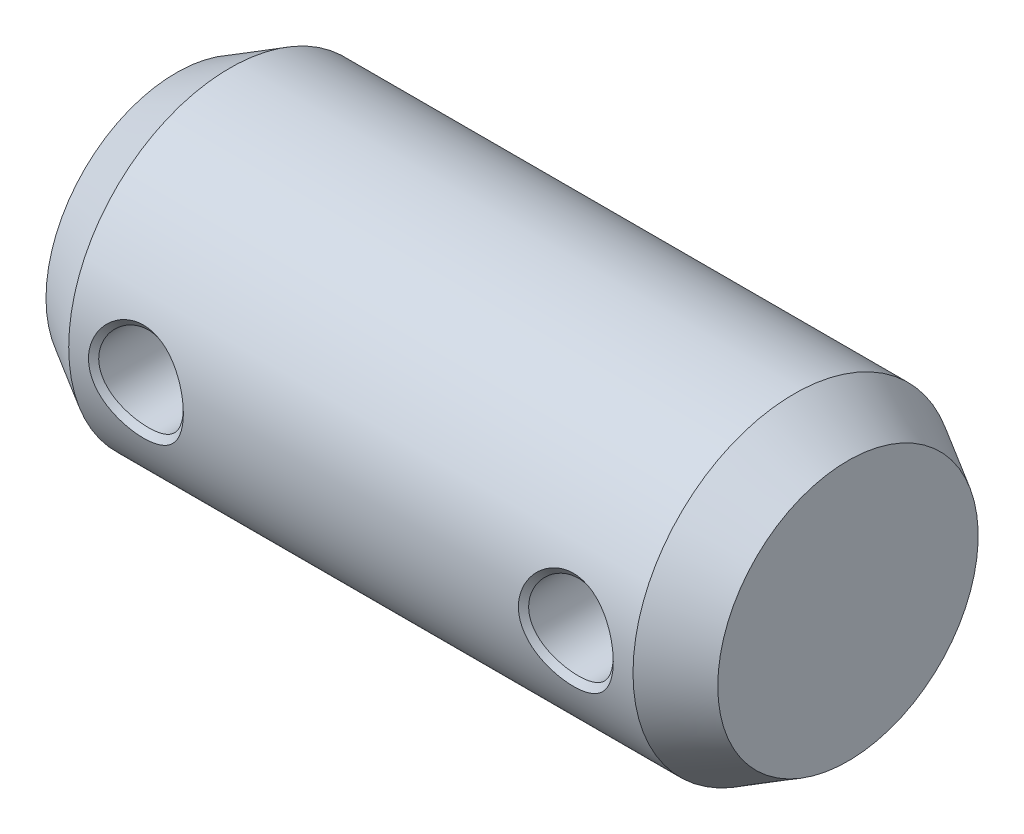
ISO-10303-21;
HEADER;
FILE_DESCRIPTION(('STEP AP214'),'2;1');
FILE_NAME('part.step','',(''),(''),'','','');
FILE_SCHEMA(('AUTOMOTIVE_DESIGN { 1 0 10303 214 1 1 1 1 }'));
ENDSEC;
DATA;
#1=APPLICATION_CONTEXT('core data for automotive mechanical design processes');
#2=APPLICATION_PROTOCOL_DEFINITION('international standard','automotive_design',2000,#1);
#3=PRODUCT_CONTEXT('',#1,'mechanical');
#4=PRODUCT('Part','Part','',(#3));
#5=PRODUCT_RELATED_PRODUCT_CATEGORY('part','',(#4));
#6=PRODUCT_DEFINITION_FORMATION('','',#4);
#7=PRODUCT_DEFINITION_CONTEXT('part definition',#1,'design');
#8=PRODUCT_DEFINITION('design','',#6,#7);
#9=PRODUCT_DEFINITION_SHAPE('','',#8);
#10=(LENGTH_UNIT() NAMED_UNIT(*) SI_UNIT(.MILLI.,.METRE.));
#11=(NAMED_UNIT(*) PLANE_ANGLE_UNIT() SI_UNIT($,.RADIAN.));
#12=(NAMED_UNIT(*) SI_UNIT($,.STERADIAN.) SOLID_ANGLE_UNIT());
#13=UNCERTAINTY_MEASURE_WITH_UNIT(LENGTH_MEASURE(1.E-05),#10,'distance_accuracy_value','');
#14=(GEOMETRIC_REPRESENTATION_CONTEXT(3) GLOBAL_UNCERTAINTY_ASSIGNED_CONTEXT((#13)) GLOBAL_UNIT_ASSIGNED_CONTEXT((#10,
#11,#12)) REPRESENTATION_CONTEXT('',''));
#15=CARTESIAN_POINT('',(0.,0.,0.));
#16=DIRECTION('',(0.,0.,1.));
#17=DIRECTION('',(1.,0.,0.));
#18=AXIS2_PLACEMENT_3D('',#15,#16,#17);
#19=CARTESIAN_POINT('',(0.,0.,0.));
#20=DIRECTION('',(-1.,0.,0.));
#21=DIRECTION('',(0.,0.,1.));
#22=AXIS2_PLACEMENT_3D('',#19,#20,#21);
#23=PLANE('',#22);
#24=CARTESIAN_POINT('',(0.,0.,0.));
#25=DIRECTION('',(-1.,0.,0.));
#26=DIRECTION('',(0.,0.,1.));
#27=AXIS2_PLACEMENT_3D('',#24,#25,#26);
#28=CIRCLE('',#27,9.69059892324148);
#29=CARTESIAN_POINT('',(0.,0.,9.69059892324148));
#30=VERTEX_POINT('',#29);
#31=EDGE_CURVE('E83',#30,#30,#28,.T.);
#32=ORIENTED_EDGE('',*,*,#31,.T.);
#33=EDGE_LOOP('',(#32));
#34=FACE_BOUND('',#33,.T.);
#35=ADVANCED_FACE('F40',(#34),#23,.T.);
#36=CARTESIAN_POINT('',(0.,0.,0.));
#37=DIRECTION('',(1.,0.,0.));
#38=DIRECTION('',(0.,0.,-1.));
#39=AXIS2_PLACEMENT_3D('',#36,#37,#38);
#40=CONICAL_SURFACE('',#39,9.69059892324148,0.5235987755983);
#41=CARTESIAN_POINT('',(4.,0.,0.));
#42=DIRECTION('',(-1.,0.,0.));
#43=DIRECTION('',(0.,0.,1.));
#44=AXIS2_PLACEMENT_3D('',#41,#42,#43);
#45=CIRCLE('',#44,12.);
#46=CARTESIAN_POINT('',(4.,0.,12.));
#47=VERTEX_POINT('',#46);
#48=EDGE_CURVE('E87',#47,#47,#45,.T.);
#49=ORIENTED_EDGE('',*,*,#48,.T.);
#50=EDGE_LOOP('',(#49));
#51=FACE_BOUND('',#50,.T.);
#52=ORIENTED_EDGE('',*,*,#31,.F.);
#53=EDGE_LOOP('',(#52));
#54=FACE_BOUND('',#53,.T.);
#55=ADVANCED_FACE('F136',(#51,#54),#40,.T.);
#56=CARTESIAN_POINT('',(0.,0.,0.));
#57=DIRECTION('',(-1.,0.,0.));
#58=DIRECTION('',(0.,0.,1.));
#59=AXIS2_PLACEMENT_3D('',#56,#57,#58);
#60=CYLINDRICAL_SURFACE('',#59,12.);
#61=CARTESIAN_POINT('',(12.5309999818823,0.,12.));
#62=CARTESIAN_POINT('',(12.53059480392,0.963675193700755,11.9998958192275));
#63=CARTESIAN_POINT('',(12.1454326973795,1.90775318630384,11.8698914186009));
#64=CARTESIAN_POINT('',(10.8475713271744,3.25018331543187,11.5692999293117));
#65=CARTESIAN_POINT('',(9.93323551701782,3.64750594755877,11.432267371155));
#66=CARTESIAN_POINT('',(8.0681782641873,3.64606472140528,11.4326364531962));
#67=CARTESIAN_POINT('',(7.15442074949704,3.25044613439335,11.5691885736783));
#68=CARTESIAN_POINT('',(5.85319854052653,1.90813389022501,11.8698611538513));
#69=CARTESIAN_POINT('',(5.46910447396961,0.96499850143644,11.9999888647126));
#70=CARTESIAN_POINT('',(5.46889559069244,-0.965652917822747,12.0000111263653));
#71=CARTESIAN_POINT('',(5.85249325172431,-1.90694169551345,11.8700886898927));
#72=CARTESIAN_POINT('',(7.15310089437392,-3.24954694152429,11.5694212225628));
#73=CARTESIAN_POINT('',(8.06918079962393,-3.64667685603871,11.4324385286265));
#74=CARTESIAN_POINT('',(9.93501776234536,-3.64689267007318,11.4324656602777));
#75=CARTESIAN_POINT('',(10.8467380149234,-3.25006313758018,11.5692062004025));
#76=CARTESIAN_POINT('',(12.1452542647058,-1.90891782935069,11.8697552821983));
#77=CARTESIAN_POINT('',(12.5314051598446,-0.963675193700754,12.0001041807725));
#78=CARTESIAN_POINT('',(12.5309999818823,0.,12.));
#79=B_SPLINE_CURVE_WITH_KNOTS('',3,(#61,#62,#63,#64,#65,#66,#67,#68,#69,#70,#71,#72,#73,#74,#75,
#76,#77,#78),.UNSPECIFIED.,.T.,.F.,(4,2,2,2,2,2,2,2,4),(-0.02219638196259,-0.0194195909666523,
-0.0166427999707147,-0.0138660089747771,-0.0110892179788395,-0.00831242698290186,
-0.00553563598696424,-0.00275884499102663,1.79460049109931E-05),.UNSPECIFIED.);
#80=CARTESIAN_POINT('',(12.5309999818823,0.,12.));
#81=VERTEX_POINT('',#80);
#82=EDGE_CURVE('E53',#81,#81,#79,.F.);
#83=ORIENTED_EDGE('',*,*,#82,.T.);
#84=EDGE_LOOP('',(#83));
#85=FACE_BOUND('',#84,.T.);
#86=CARTESIAN_POINT('',(44.5309999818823,0.,12.));
#87=CARTESIAN_POINT('',(44.53059480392,0.963675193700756,11.9998958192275));
#88=CARTESIAN_POINT('',(44.1454326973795,1.90775318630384,11.8698914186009));
#89=CARTESIAN_POINT('',(42.8475713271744,3.25018331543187,11.5692999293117));
#90=CARTESIAN_POINT('',(41.9332355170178,3.64750594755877,11.432267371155));
#91=CARTESIAN_POINT('',(40.0681782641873,3.64606472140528,11.4326364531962));
#92=CARTESIAN_POINT('',(39.154420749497,3.25044613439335,11.5691885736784));
#93=CARTESIAN_POINT('',(37.8531985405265,1.90813389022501,11.8698611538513));
#94=CARTESIAN_POINT('',(37.4691044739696,0.96499850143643,11.9999888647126));
#95=CARTESIAN_POINT('',(37.4688955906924,-0.965652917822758,12.0000111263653));
#96=CARTESIAN_POINT('',(37.8524932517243,-1.90694169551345,11.8700886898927));
#97=CARTESIAN_POINT('',(39.1531008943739,-3.24954694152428,11.5694212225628));
#98=CARTESIAN_POINT('',(40.0691807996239,-3.6466768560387,11.4324385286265));
#99=CARTESIAN_POINT('',(41.9350177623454,-3.64689267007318,11.4324656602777));
#100=CARTESIAN_POINT('',(42.8467380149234,-3.25006313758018,11.5692062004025));
#101=CARTESIAN_POINT('',(44.1452542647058,-1.90891782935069,11.8697552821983));
#102=CARTESIAN_POINT('',(44.5314051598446,-0.963675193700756,12.0001041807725));
#103=CARTESIAN_POINT('',(44.5309999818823,0.,12.));
#104=B_SPLINE_CURVE_WITH_KNOTS('',3,(#86,#87,#88,#89,#90,#91,#92,#93,#94,#95,#96,#97,#98,#99,
#100,#101,#102,#103),.UNSPECIFIED.,.T.,.F.,(4,2,2,2,2,2,2,2,4),(-0.0221963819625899,
-0.0194195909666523,-0.0166427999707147,-0.0138660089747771,-0.0110892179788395,
-0.00831242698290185,-0.00553563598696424,-0.00275884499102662,1.79460049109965E-05),.UNSPECIFIED.);
#105=CARTESIAN_POINT('',(44.5309999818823,0.,12.));
#106=VERTEX_POINT('',#105);
#107=EDGE_CURVE('E56',#106,#106,#104,.F.);
#108=ORIENTED_EDGE('',*,*,#107,.T.);
#109=EDGE_LOOP('',(#108));
#110=FACE_BOUND('',#109,.T.);
#111=CARTESIAN_POINT('',(12.5309999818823,0.,-12.));
#112=CARTESIAN_POINT('',(12.53059480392,-0.96367519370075,-11.9998958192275));
#113=CARTESIAN_POINT('',(12.1454326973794,-1.90775318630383,-11.8698914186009));
#114=CARTESIAN_POINT('',(10.8475713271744,-3.25018331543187,-11.5692999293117));
#115=CARTESIAN_POINT('',(9.93323551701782,-3.64750594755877,-11.432267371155));
#116=CARTESIAN_POINT('',(8.0681782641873,-3.64606472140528,-11.4326364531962));
#117=CARTESIAN_POINT('',(7.15442074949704,-3.25044613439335,-11.5691885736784));
#118=CARTESIAN_POINT('',(5.85319854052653,-1.90813389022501,-11.8698611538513));
#119=CARTESIAN_POINT('',(5.46910447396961,-0.964998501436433,-11.9999888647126));
#120=CARTESIAN_POINT('',(5.46889559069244,0.965652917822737,-12.0000111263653));
#121=CARTESIAN_POINT('',(5.85249325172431,1.90694169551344,-11.8700886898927));
#122=CARTESIAN_POINT('',(7.15310089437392,3.24954694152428,-11.5694212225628));
#123=CARTESIAN_POINT('',(8.06918079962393,3.64667685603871,-11.4324385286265));
#124=CARTESIAN_POINT('',(9.93501776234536,3.64689267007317,-11.4324656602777));
#125=CARTESIAN_POINT('',(10.8467380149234,3.25006313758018,-11.5692062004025));
#126=CARTESIAN_POINT('',(12.1452542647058,1.90891782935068,-11.8697552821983));
#127=CARTESIAN_POINT('',(12.5314051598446,0.963675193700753,-12.0001041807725));
#128=CARTESIAN_POINT('',(12.5309999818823,0.,-12.));
#129=B_SPLINE_CURVE_WITH_KNOTS('',3,(#111,#112,#113,#114,#115,#116,#117,#118,#119,#120,#121,
#122,#123,#124,#125,#126,#127,#128),.UNSPECIFIED.,.T.,.F.,(4,2,2,2,2,2,2,2,4),
(-0.02219638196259,-0.0194195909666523,-0.0166427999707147,-0.0138660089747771,
-0.0110892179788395,-0.00831242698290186,-0.00553563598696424,-0.00275884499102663,
1.79460049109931E-05),.UNSPECIFIED.);
#130=CARTESIAN_POINT('',(12.5309999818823,0.,-12.));
#131=VERTEX_POINT('',#130);
#132=EDGE_CURVE('E63',#131,#131,#129,.F.);
#133=ORIENTED_EDGE('',*,*,#132,.T.);
#134=EDGE_LOOP('',(#133));
#135=FACE_BOUND('',#134,.T.);
#136=CARTESIAN_POINT('',(44.5309999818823,0.,-12.));
#137=CARTESIAN_POINT('',(44.53059480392,-0.963675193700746,-11.9998958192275));
#138=CARTESIAN_POINT('',(44.1454326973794,-1.90775318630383,-11.8698914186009));
#139=CARTESIAN_POINT('',(42.8475713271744,-3.25018331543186,-11.5692999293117));
#140=CARTESIAN_POINT('',(41.9332355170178,-3.64750594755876,-11.432267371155));
#141=CARTESIAN_POINT('',(40.0681782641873,-3.64606472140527,-11.4326364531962));
#142=CARTESIAN_POINT('',(39.154420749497,-3.25044613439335,-11.5691885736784));
#143=CARTESIAN_POINT('',(37.8531985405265,-1.90813389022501,-11.8698611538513));
#144=CARTESIAN_POINT('',(37.4691044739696,-0.964998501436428,-11.9999888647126));
#145=CARTESIAN_POINT('',(37.4688955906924,0.965652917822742,-12.0000111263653));
#146=CARTESIAN_POINT('',(37.8524932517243,1.90694169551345,-11.8700886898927));
#147=CARTESIAN_POINT('',(39.1531008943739,3.24954694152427,-11.5694212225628));
#148=CARTESIAN_POINT('',(40.0691807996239,3.6466768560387,-11.4324385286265));
#149=CARTESIAN_POINT('',(41.9350177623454,3.64689267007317,-11.4324656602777));
#150=CARTESIAN_POINT('',(42.8467380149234,3.25006313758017,-11.5692062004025));
#151=CARTESIAN_POINT('',(44.1452542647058,1.90891782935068,-11.8697552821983));
#152=CARTESIAN_POINT('',(44.5314051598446,0.963675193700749,-12.0001041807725));
#153=CARTESIAN_POINT('',(44.5309999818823,0.,-12.));
#154=B_SPLINE_CURVE_WITH_KNOTS('',3,(#136,#137,#138,#139,#140,#141,#142,#143,#144,#145,#146,
#147,#148,#149,#150,#151,#152,#153),.UNSPECIFIED.,.T.,.F.,(4,2,2,2,2,2,2,2,4),
(-0.0221963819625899,-0.0194195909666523,-0.0166427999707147,-0.0138660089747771,
-0.0110892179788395,-0.00831242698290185,-0.00553563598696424,-0.00275884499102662,
1.79460049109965E-05),.UNSPECIFIED.);
#155=CARTESIAN_POINT('',(44.5309999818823,0.,-12.));
#156=VERTEX_POINT('',#155);
#157=EDGE_CURVE('E67',#156,#156,#154,.F.);
#158=ORIENTED_EDGE('',*,*,#157,.T.);
#159=EDGE_LOOP('',(#158));
#160=FACE_BOUND('',#159,.T.);
#161=CARTESIAN_POINT('',(46.,0.,0.));
#162=DIRECTION('',(-1.,0.,0.));
#163=DIRECTION('',(0.,0.,1.));
#164=AXIS2_PLACEMENT_3D('',#161,#162,#163);
#165=CIRCLE('',#164,12.);
#166=CARTESIAN_POINT('',(46.,0.,12.));
#167=VERTEX_POINT('',#166);
#168=EDGE_CURVE('E91',#167,#167,#165,.T.);
#169=ORIENTED_EDGE('',*,*,#168,.T.);
#170=EDGE_LOOP('',(#169));
#171=FACE_BOUND('',#170,.T.);
#172=ORIENTED_EDGE('',*,*,#48,.F.);
#173=EDGE_LOOP('',(#172));
#174=FACE_BOUND('',#173,.T.);
#175=ADVANCED_FACE('F127',(#85,#110,#135,#160,#171,#174),#60,.T.);
#176=CARTESIAN_POINT('',(46.,0.,0.));
#177=DIRECTION('',(-1.,0.,0.));
#178=DIRECTION('',(0.,0.,1.));
#179=AXIS2_PLACEMENT_3D('',#176,#177,#178);
#180=CONICAL_SURFACE('',#179,12.,0.5235987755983);
#181=CARTESIAN_POINT('',(50.,0.,0.));
#182=DIRECTION('',(-1.,0.,0.));
#183=DIRECTION('',(0.,0.,1.));
#184=AXIS2_PLACEMENT_3D('',#181,#182,#183);
#185=CIRCLE('',#184,9.69059892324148);
#186=CARTESIAN_POINT('',(50.,0.,9.69059892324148));
#187=VERTEX_POINT('',#186);
#188=EDGE_CURVE('E361',#187,#187,#185,.T.);
#189=ORIENTED_EDGE('',*,*,#188,.T.);
#190=EDGE_LOOP('',(#189));
#191=FACE_BOUND('',#190,.T.);
#192=ORIENTED_EDGE('',*,*,#168,.F.);
#193=EDGE_LOOP('',(#192));
#194=FACE_BOUND('',#193,.T.);
#195=ADVANCED_FACE('F140',(#191,#194),#180,.T.);
#196=CARTESIAN_POINT('',(50.,9.69059892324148,0.));
#197=DIRECTION('',(1.,0.,0.));
#198=DIRECTION('',(0.,0.,-1.));
#199=AXIS2_PLACEMENT_3D('',#196,#197,#198);
#200=PLANE('',#199);
#201=ORIENTED_EDGE('',*,*,#188,.F.);
#202=EDGE_LOOP('',(#201));
#203=FACE_BOUND('',#202,.T.);
#204=ADVANCED_FACE('F305',(#203),#200,.T.);
#205=CARTESIAN_POINT('',(41.,0.,-12.));
#206=DIRECTION('',(0.,0.,1.));
#207=DIRECTION('',(1.,0.,0.));
#208=AXIS2_PLACEMENT_3D('',#205,#206,#207);
#209=CYLINDRICAL_SURFACE('',#208,3.15);
#210=CARTESIAN_POINT('',(44.15,0.,11.6190000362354));
#211=CARTESIAN_POINT('',(44.1500240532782,-0.0519717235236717,11.6190069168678));
#212=CARTESIAN_POINT('',(44.1487009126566,-0.103940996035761,11.6185202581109));
#213=CARTESIAN_POINT('',(44.1434102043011,-0.207646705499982,11.616610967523));
#214=CARTESIAN_POINT('',(44.13944676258,-0.259383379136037,11.6151897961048));
#215=CARTESIAN_POINT('',(44.128929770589,-0.36251406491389,11.611463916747));
#216=CARTESIAN_POINT('',(44.1223784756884,-0.413908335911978,11.6091599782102));
#217=CARTESIAN_POINT('',(44.1067417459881,-0.516246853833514,11.6037216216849));
#218=CARTESIAN_POINT('',(44.0976571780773,-0.56719124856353,11.6005874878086));
#219=CARTESIAN_POINT('',(44.0770088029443,-0.668522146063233,11.5935413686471));
#220=CARTESIAN_POINT('',(44.0654448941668,-0.718908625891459,11.5896293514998));
#221=CARTESIAN_POINT('',(44.0398924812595,-0.819016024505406,11.5810799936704));
#222=CARTESIAN_POINT('',(44.0259032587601,-0.868736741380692,11.5764424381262));
#223=CARTESIAN_POINT('',(43.9955544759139,-0.967404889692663,11.5664943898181));
#224=CARTESIAN_POINT('',(43.9791938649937,-1.01635196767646,11.5611835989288));
#225=CARTESIAN_POINT('',(43.9441562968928,-1.11336508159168,11.5499413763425));
#226=CARTESIAN_POINT('',(43.9254781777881,-1.16143066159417,11.5440096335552));
#227=CARTESIAN_POINT('',(43.8858593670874,-1.25657295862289,11.5315777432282));
#228=CARTESIAN_POINT('',(43.8649175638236,-1.30364917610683,11.5250773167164));
#229=CARTESIAN_POINT('',(43.8208250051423,-1.39670485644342,11.5115602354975));
#230=CARTESIAN_POINT('',(43.7976732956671,-1.44268383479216,11.5045433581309));
#231=CARTESIAN_POINT('',(43.7492144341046,-1.53343708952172,11.4900456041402));
#232=CARTESIAN_POINT('',(43.7239065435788,-1.578210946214,11.4825645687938));
#233=CARTESIAN_POINT('',(43.6711888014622,-1.66644591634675,11.4671904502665));
#234=CARTESIAN_POINT('',(43.6437784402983,-1.709906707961,11.4592972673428));
#235=CARTESIAN_POINT('',(43.5869091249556,-1.79540761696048,11.4431518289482));
#236=CARTESIAN_POINT('',(43.5574498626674,-1.83744751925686,11.4348995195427));
#237=CARTESIAN_POINT('',(43.496536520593,-1.91999816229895,11.4180850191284));
#238=CARTESIAN_POINT('',(43.4650822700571,-1.96050877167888,11.4095228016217));
#239=CARTESIAN_POINT('',(43.4002313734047,-2.03989440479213,11.3921518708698));
#240=CARTESIAN_POINT('',(43.3668345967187,-2.07876931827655,11.3833431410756));
#241=CARTESIAN_POINT('',(43.2981564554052,-2.15476958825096,11.3654896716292));
#242=CARTESIAN_POINT('',(43.2628748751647,-2.19189474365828,11.3564449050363));
#243=CARTESIAN_POINT('',(43.1904803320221,-2.26429503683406,11.3383311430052));
#244=CARTESIAN_POINT('',(43.1533676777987,-2.29957048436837,11.3292621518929));
#245=CARTESIAN_POINT('',(43.077414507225,-2.36822547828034,11.3113178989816));
#246=CARTESIAN_POINT('',(43.0385747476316,-2.4016058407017,11.3024425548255));
#247=CARTESIAN_POINT('',(42.9592768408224,-2.46641301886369,11.2849020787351));
#248=CARTESIAN_POINT('',(42.9188192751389,-2.4978405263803,11.2762368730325));
#249=CARTESIAN_POINT('',(42.8363897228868,-2.55869184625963,11.259186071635));
#250=CARTESIAN_POINT('',(42.7944182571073,-2.58811633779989,11.2508003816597));
#251=CARTESIAN_POINT('',(42.709066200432,-2.64490931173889,11.2343638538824));
#252=CARTESIAN_POINT('',(42.6656861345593,-2.6722785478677,11.2263128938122));
#253=CARTESIAN_POINT('',(42.5776217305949,-2.72490915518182,11.2106048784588));
#254=CARTESIAN_POINT('',(42.532937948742,-2.75017140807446,11.2029476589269));
#255=CARTESIAN_POINT('',(42.4423710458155,-2.79853599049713,11.1880851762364));
#256=CARTESIAN_POINT('',(42.3964885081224,-2.82163934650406,11.1808796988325));
#257=CARTESIAN_POINT('',(42.3036290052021,-2.86563409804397,11.1669790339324));
#258=CARTESIAN_POINT('',(42.2566526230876,-2.88652664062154,11.1602835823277));
#259=CARTESIAN_POINT('',(42.1617103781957,-2.92604774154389,11.1474612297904));
#260=CARTESIAN_POINT('',(42.1137450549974,-2.94467749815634,11.1413340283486));
#261=CARTESIAN_POINT('',(42.0169299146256,-2.97962107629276,11.1297064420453));
#262=CARTESIAN_POINT('',(41.9680805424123,-2.99593602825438,11.1242057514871));
#263=CARTESIAN_POINT('',(41.8696023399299,-3.02619816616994,11.1138894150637));
#264=CARTESIAN_POINT('',(41.819973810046,-3.04014624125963,11.1090735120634));
#265=CARTESIAN_POINT('',(41.7200423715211,-3.06562297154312,11.1001849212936));
#266=CARTESIAN_POINT('',(41.6697395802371,-3.07715204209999,11.0961121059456));
#267=CARTESIAN_POINT('',(41.56856473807,-3.09773934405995,11.0887677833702));
#268=CARTESIAN_POINT('',(41.5176926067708,-3.10679722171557,11.0854963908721));
#269=CARTESIAN_POINT('',(41.4154841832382,-3.12239102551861,11.0798128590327));
#270=CARTESIAN_POINT('',(41.3641476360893,-3.12892546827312,11.0774012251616));
#271=CARTESIAN_POINT('',(41.261115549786,-3.13942163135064,11.0734951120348));
#272=CARTESIAN_POINT('',(41.2094196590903,-3.14338031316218,11.0720017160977));
#273=CARTESIAN_POINT('',(41.1057735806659,-3.14867470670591,11.0699893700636));
#274=CARTESIAN_POINT('',(41.0538230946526,-3.15000533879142,11.0694723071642));
#275=CARTESIAN_POINT('',(40.9499075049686,-3.14999354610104,11.0694712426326));
#276=CARTESIAN_POINT('',(40.8979424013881,-3.14865035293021,11.0699875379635));
#277=CARTESIAN_POINT('',(40.7942400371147,-3.14333151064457,11.0720001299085));
#278=CARTESIAN_POINT('',(40.7425025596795,-3.13935953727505,11.0734950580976));
#279=CARTESIAN_POINT('',(40.6393634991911,-3.12883730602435,11.0774052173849));
#280=CARTESIAN_POINT('',(40.5879617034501,-3.12228888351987,11.0798197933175));
#281=CARTESIAN_POINT('',(40.485602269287,-3.10666723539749,11.0855102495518));
#282=CARTESIAN_POINT('',(40.4346445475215,-3.0975944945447,11.0887859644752));
#283=CARTESIAN_POINT('',(40.3332813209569,-3.07697724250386,11.0961397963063));
#284=CARTESIAN_POINT('',(40.2828759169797,-3.06543228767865,11.1002180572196));
#285=CARTESIAN_POINT('',(40.1827253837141,-3.03992321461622,11.1091182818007));
#286=CARTESIAN_POINT('',(40.1329805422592,-3.02595807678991,11.1139405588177));
#287=CARTESIAN_POINT('',(40.0342592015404,-2.99566090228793,11.1242702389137));
#288=CARTESIAN_POINT('',(39.985283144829,-2.97932755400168,11.1297780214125));
#289=CARTESIAN_POINT('',(39.8882074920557,-2.94434594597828,11.1414202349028));
#290=CARTESIAN_POINT('',(39.8401084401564,-2.92569630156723,11.1475550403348));
#291=CARTESIAN_POINT('',(39.7448949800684,-2.8861338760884,11.1603928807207));
#292=CARTESIAN_POINT('',(39.6977811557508,-2.86521979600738,11.1670962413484));
#293=CARTESIAN_POINT('',(39.6046464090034,-2.82118012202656,11.1810128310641));
#294=CARTESIAN_POINT('',(39.5586260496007,-2.79805341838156,11.1882263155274));
#295=CARTESIAN_POINT('',(39.4677865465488,-2.74964001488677,11.20310473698));
#296=CARTESIAN_POINT('',(39.422967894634,-2.72435244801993,11.2107698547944));
#297=CARTESIAN_POINT('',(39.3346402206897,-2.67166880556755,11.2264933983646));
#298=CARTESIAN_POINT('',(39.2911315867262,-2.64427211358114,11.2345519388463));
#299=CARTESIAN_POINT('',(39.2055322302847,-2.58742162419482,11.2510031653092));
#300=CARTESIAN_POINT('',(39.1634417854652,-2.55796742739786,11.2593959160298));
#301=CARTESIAN_POINT('',(39.0807877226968,-2.49705365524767,11.2764601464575));
#302=CARTESIAN_POINT('',(39.0402242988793,-2.46559382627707,11.285131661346));
#303=CARTESIAN_POINT('',(38.9607308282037,-2.40071950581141,11.3026839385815));
#304=CARTESIAN_POINT('',(38.9218009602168,-2.36730480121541,11.3115647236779));
#305=CARTESIAN_POINT('',(38.8456898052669,-2.29857558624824,11.3295184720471));
#306=CARTESIAN_POINT('',(38.8085088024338,-2.26326076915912,11.3385914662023));
#307=CARTESIAN_POINT('',(38.7360015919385,-2.1907949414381,11.3567109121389));
#308=CARTESIAN_POINT('',(38.7006747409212,-2.15364457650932,11.3657573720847));
#309=CARTESIAN_POINT('',(38.631927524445,-2.07762192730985,11.3836112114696));
#310=CARTESIAN_POINT('',(38.5985056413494,-2.03875105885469,11.3924187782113));
#311=CARTESIAN_POINT('',(38.5336258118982,-1.95939470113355,11.4097844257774));
#312=CARTESIAN_POINT('',(38.5021665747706,-1.91891030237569,11.4183426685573));
#313=CARTESIAN_POINT('',(38.4412608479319,-1.83642990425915,11.4351468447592));
#314=CARTESIAN_POINT('',(38.411813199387,-1.79443479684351,11.4433929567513));
#315=CARTESIAN_POINT('',(38.3549819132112,-1.70903698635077,11.4595240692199));
#316=CARTESIAN_POINT('',(38.3275971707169,-1.66563505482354,11.4674092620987));
#317=CARTESIAN_POINT('',(38.2749424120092,-1.57752723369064,11.4827659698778));
#318=CARTESIAN_POINT('',(38.2496712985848,-1.53282203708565,11.4902376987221));
#319=CARTESIAN_POINT('',(38.2012947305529,-1.4422113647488,11.5047159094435));
#320=CARTESIAN_POINT('',(38.1781881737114,-1.39630651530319,11.5117226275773));
#321=CARTESIAN_POINT('',(38.1341916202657,-1.30340018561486,11.5252189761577));
#322=CARTESIAN_POINT('',(38.1133005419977,-1.25639925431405,11.5317088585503));
#323=CARTESIAN_POINT('',(38.0737858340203,-1.16140442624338,11.5441197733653));
#324=CARTESIAN_POINT('',(38.0551612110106,-1.11341097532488,11.550041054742));
#325=CARTESIAN_POINT('',(38.0202302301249,-1.01653479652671,11.5612630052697));
#326=CARTESIAN_POINT('',(38.0039230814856,-0.967652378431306,11.566563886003));
#327=CARTESIAN_POINT('',(37.9736777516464,-0.869101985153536,11.5764933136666));
#328=CARTESIAN_POINT('',(37.9597391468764,-0.819434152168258,11.5811219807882));
#329=CARTESIAN_POINT('',(37.9342814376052,-0.719416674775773,11.5896553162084));
#330=CARTESIAN_POINT('',(37.9227624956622,-0.669066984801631,11.5935599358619));
#331=CARTESIAN_POINT('',(37.9021944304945,-0.567789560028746,11.6005935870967));
#332=CARTESIAN_POINT('',(37.8931463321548,-0.516861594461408,11.6037222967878));
#333=CARTESIAN_POINT('',(37.877569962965,-0.414531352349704,11.6091526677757));
#334=CARTESIAN_POINT('',(37.8710439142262,-0.363128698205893,11.6114535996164));
#335=CARTESIAN_POINT('',(37.8605614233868,-0.259952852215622,11.6151770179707));
#336=CARTESIAN_POINT('',(37.8566087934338,-0.208179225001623,11.6165982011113));
#337=CARTESIAN_POINT('',(37.8513221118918,-0.104364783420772,11.6185111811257));
#338=CARTESIAN_POINT('',(37.8499939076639,-0.0523236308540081,11.6190009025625));
#339=CARTESIAN_POINT('',(37.8500061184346,0.051764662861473,11.618999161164));
#340=CARTESIAN_POINT('',(37.8513468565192,0.103811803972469,11.6185075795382));
#341=CARTESIAN_POINT('',(37.8566602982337,0.207649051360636,11.6165895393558));
#342=CARTESIAN_POINT('',(37.8606277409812,0.259439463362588,11.6151649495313));
#343=CARTESIAN_POINT('',(37.8711407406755,0.362658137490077,11.6114339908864));
#344=CARTESIAN_POINT('',(37.8776829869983,0.414086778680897,11.6091287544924));
#345=CARTESIAN_POINT('',(37.8932926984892,0.516476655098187,11.6036890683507));
#346=CARTESIAN_POINT('',(37.9023583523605,0.567438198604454,11.600555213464));
#347=CARTESIAN_POINT('',(37.9229623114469,0.668788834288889,11.5935107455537));
#348=CARTESIAN_POINT('',(37.9344999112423,0.719178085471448,11.5896003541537));
#349=CARTESIAN_POINT('',(37.9599956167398,0.819279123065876,11.5810550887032));
#350=CARTESIAN_POINT('',(37.9739537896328,0.86899089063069,11.5764201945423));
#351=CARTESIAN_POINT('',(38.0042388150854,0.96763196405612,11.5664780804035));
#352=CARTESIAN_POINT('',(38.0205662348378,1.01656107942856,11.5611706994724));
#353=CARTESIAN_POINT('',(38.0555381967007,1.11353182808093,11.5499356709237));
#354=CARTESIAN_POINT('',(38.074183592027,1.16157312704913,11.5440077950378));
#355=CARTESIAN_POINT('',(38.1137401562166,1.25666318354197,11.5315837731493));
#356=CARTESIAN_POINT('',(38.1346523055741,1.30371150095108,11.5250873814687));
#357=CARTESIAN_POINT('',(38.1786911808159,1.39671048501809,11.5115782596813));
#358=CARTESIAN_POINT('',(38.2018189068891,1.44266064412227,11.5045652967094));
#359=CARTESIAN_POINT('',(38.2502378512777,1.53335816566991,11.4900750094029));
#360=CARTESIAN_POINT('',(38.2755300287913,1.57810498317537,11.4825974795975));
#361=CARTESIAN_POINT('',(38.3282268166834,1.66629060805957,11.4672297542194));
#362=CARTESIAN_POINT('',(38.3556323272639,1.7097288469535,11.4593393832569));
#363=CARTESIAN_POINT('',(38.4125048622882,1.79519220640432,11.4431986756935));
#364=CARTESIAN_POINT('',(38.4419727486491,1.83721672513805,11.4349481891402));
#365=CARTESIAN_POINT('',(38.5029186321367,1.91974708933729,11.4181361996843));
#366=CARTESIAN_POINT('',(38.5343975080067,1.96025225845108,11.409574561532));
#367=CARTESIAN_POINT('',(38.5993156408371,2.03964011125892,11.3922032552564));
#368=CARTESIAN_POINT('',(38.6327558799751,2.07852196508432,11.383393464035));
#369=CARTESIAN_POINT('',(38.7015404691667,2.15455310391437,11.3655364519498));
#370=CARTESIAN_POINT('',(38.7368860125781,2.19170127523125,11.3564890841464));
#371=CARTESIAN_POINT('',(38.8094213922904,2.26415130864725,11.3383701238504));
#372=CARTESIAN_POINT('',(38.8466113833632,2.29945301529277,11.3292985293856));
#373=CARTESIAN_POINT('',(38.9227234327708,2.36814907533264,11.3113504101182));
#374=CARTESIAN_POINT('',(38.961644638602,2.40154434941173,11.3024737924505));
#375=CARTESIAN_POINT('',(39.0411073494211,2.46637256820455,11.2849321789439));
#376=CARTESIAN_POINT('',(39.081648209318,2.49780628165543,11.2762671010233));
#377=CARTESIAN_POINT('',(39.1642451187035,2.55866260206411,11.2592175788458));
#378=CARTESIAN_POINT('',(39.2063006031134,2.58808594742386,11.2508330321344));
#379=CARTESIAN_POINT('',(39.2918200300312,2.64487092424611,11.2343995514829));
#380=CARTESIAN_POINT('',(39.335283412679,2.67223336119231,11.2263504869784));
#381=CARTESIAN_POINT('',(39.4235124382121,2.72484626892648,11.2106467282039));
#382=CARTESIAN_POINT('',(39.468277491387,2.75009767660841,11.2029918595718));
#383=CARTESIAN_POINT('',(39.5590035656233,2.79843808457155,11.1881342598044));
#384=CARTESIAN_POINT('',(39.6049639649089,2.8215281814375,11.1809313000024));
#385=CARTESIAN_POINT('',(39.6979744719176,2.86549552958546,11.1670355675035));
#386=CARTESIAN_POINT('',(39.7450239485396,2.8863740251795,11.1603425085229));
#387=CARTESIAN_POINT('',(39.8401063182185,2.92586773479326,11.1475245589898));
#388=CARTESIAN_POINT('',(39.8881386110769,2.94448428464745,11.1413993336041));
#389=CARTESIAN_POINT('',(39.9850802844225,2.97940372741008,11.1297750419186));
#390=CARTESIAN_POINT('',(40.0339891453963,2.99570794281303,11.1242756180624));
#391=CARTESIAN_POINT('',(40.1325775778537,3.02595244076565,11.1139608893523));
#392=CARTESIAN_POINT('',(40.1822567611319,3.03989387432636,11.1091452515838));
#393=CARTESIAN_POINT('',(40.2822794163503,3.06536271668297,11.1002559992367));
#394=CARTESIAN_POINT('',(40.3326226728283,3.07689088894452,11.0961821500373));
#395=CARTESIAN_POINT('',(40.4338670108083,3.09748325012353,11.088834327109));
#396=CARTESIAN_POINT('',(40.4847680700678,3.10654753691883,11.0855603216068));
#397=CARTESIAN_POINT('',(40.5870215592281,3.12216277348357,11.0798698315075));
#398=CARTESIAN_POINT('',(40.6383741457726,3.12871281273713,11.0774536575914));
#399=CARTESIAN_POINT('',(40.7414241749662,3.13924934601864,11.0735366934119));
#400=CARTESIAN_POINT('',(40.7931218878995,3.14323351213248,11.0720367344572));
#401=CARTESIAN_POINT('',(40.8967560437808,3.14859299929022,11.0700085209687));
#402=CARTESIAN_POINT('',(40.9486927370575,3.14996411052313,11.0694818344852));
#403=CARTESIAN_POINT('',(41.0525683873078,3.15003576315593,11.0694613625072));
#404=CARTESIAN_POINT('',(41.1045073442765,3.14873631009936,11.0699675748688));
#405=CARTESIAN_POINT('',(41.2081486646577,3.14349525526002,11.0719623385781));
#406=CARTESIAN_POINT('',(41.2598512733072,3.1395578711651,11.0734493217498));
#407=CARTESIAN_POINT('',(41.3629126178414,3.12909925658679,11.0773449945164));
#408=CARTESIAN_POINT('',(41.4142716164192,3.12258030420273,11.0797528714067));
#409=CARTESIAN_POINT('',(41.5165381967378,3.10701174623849,11.0854313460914));
#410=CARTESIAN_POINT('',(41.5674459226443,3.09796298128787,11.0887016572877));
#411=CARTESIAN_POINT('',(41.6687026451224,3.07738871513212,11.0960458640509));
#412=CARTESIAN_POINT('',(41.7190516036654,3.06586304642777,11.1001198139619));
#413=CARTESIAN_POINT('',(41.8190834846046,3.04038813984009,11.1090124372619));
#414=CARTESIAN_POINT('',(41.8687661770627,3.02643808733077,11.1138313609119));
#415=CARTESIAN_POINT('',(41.9673582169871,2.99616731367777,11.12415518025));
#416=CARTESIAN_POINT('',(42.0162671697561,2.9798454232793,11.1296604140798));
#417=CARTESIAN_POINT('',(42.1132043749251,2.94488356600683,11.1412982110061));
#418=CARTESIAN_POINT('',(42.1612321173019,2.9262423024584,11.1474311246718));
#419=CARTESIAN_POINT('',(42.2562994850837,2.88669407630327,11.1602657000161));
#420=CARTESIAN_POINT('',(42.3033385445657,2.8657858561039,11.1669676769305));
#421=CARTESIAN_POINT('',(42.3963210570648,2.82175593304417,11.180881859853));
#422=CARTESIAN_POINT('',(42.4422639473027,2.79863312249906,11.1880943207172));
#423=CARTESIAN_POINT('',(42.532946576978,2.75022612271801,11.2029709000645));
#424=CARTESIAN_POINT('',(42.5776858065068,2.72494103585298,11.2106352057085));
#425=CARTESIAN_POINT('',(42.6658534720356,2.67226155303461,11.2263571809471));
#426=CARTESIAN_POINT('',(42.7092814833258,2.64486648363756,11.2344149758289));
#427=CARTESIAN_POINT('',(42.7947191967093,2.58801900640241,11.2508646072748));
#428=CARTESIAN_POINT('',(42.8367285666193,2.55856612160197,11.259256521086));
#429=CARTESIAN_POINT('',(42.9192208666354,2.49765533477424,11.2763188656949));
#430=CARTESIAN_POINT('',(42.9597035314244,2.46619708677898,11.2849893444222));
#431=CARTESIAN_POINT('',(43.0390365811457,2.40132675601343,11.3025390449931));
#432=CARTESIAN_POINT('',(43.0778867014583,2.36791435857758,11.3114183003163));
#433=CARTESIAN_POINT('',(43.1538404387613,2.29919150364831,11.3293688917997));
#434=CARTESIAN_POINT('',(43.190943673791,2.26388063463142,11.3384402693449));
#435=CARTESIAN_POINT('',(43.2633065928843,2.1914144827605,11.3565564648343));
#436=CARTESIAN_POINT('',(43.2985663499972,2.15425927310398,11.3656012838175));
#437=CARTESIAN_POINT('',(43.3671989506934,2.07821138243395,11.3834523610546));
#438=CARTESIAN_POINT('',(43.4005723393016,2.0393192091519,11.3922586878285));
#439=CARTESIAN_POINT('',(43.4653731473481,1.95990794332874,11.4096229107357));
#440=CARTESIAN_POINT('',(43.4968009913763,1.91938920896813,11.4181808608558));
#441=CARTESIAN_POINT('',(43.5576599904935,1.83683065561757,11.4349853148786));
#442=CARTESIAN_POINT('',(43.5870915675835,1.79479116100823,11.4432318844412));
#443=CARTESIAN_POINT('',(43.6439049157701,1.70929803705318,11.4593647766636));
#444=CARTESIAN_POINT('',(43.6712871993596,1.66584476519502,11.4672511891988));
#445=CARTESIAN_POINT('',(43.7239493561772,1.57763064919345,11.4826111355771));
#446=CARTESIAN_POINT('',(43.7492298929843,1.53287022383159,11.4900847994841));
#447=CARTESIAN_POINT('',(43.7976357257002,1.44214842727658,11.504567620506));
#448=CARTESIAN_POINT('',(43.8207618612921,1.39618753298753,11.5115769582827));
#449=CARTESIAN_POINT('',(43.8648060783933,1.30317140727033,11.5250792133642));
#450=CARTESIAN_POINT('',(43.8857251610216,1.25611668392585,11.5315723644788));
#451=CARTESIAN_POINT('',(43.9253024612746,1.16101954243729,11.5439904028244));
#452=CARTESIAN_POINT('',(43.9439617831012,1.11297762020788,11.549915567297));
#453=CARTESIAN_POINT('',(43.9789668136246,1.01601276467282,11.5611457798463));
#454=CARTESIAN_POINT('',(43.9953136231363,0.967090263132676,11.5664511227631));
#455=CARTESIAN_POINT('',(44.0256409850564,0.868470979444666,11.5763898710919));
#456=CARTESIAN_POINT('',(44.0396224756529,0.818774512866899,11.5810235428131));
#457=CARTESIAN_POINT('',(44.065166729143,0.71871408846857,11.5895671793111));
#458=CARTESIAN_POINT('',(44.0767300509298,0.668350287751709,11.5934773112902));
#459=CARTESIAN_POINT('',(44.0973856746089,0.567061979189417,11.600522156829));
#460=CARTESIAN_POINT('',(44.1064778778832,0.516137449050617,11.6036568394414));
#461=CARTESIAN_POINT('',(44.1221394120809,0.41383463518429,11.6090992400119));
#462=CARTESIAN_POINT('',(44.1287076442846,0.362456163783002,11.6114065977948));
#463=CARTESIAN_POINT('',(44.1392691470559,0.259351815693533,11.6151427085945));
#464=CARTESIAN_POINT('',(44.14325991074,0.207625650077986,11.6165706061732));
#465=CARTESIAN_POINT('',(44.1486169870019,0.103934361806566,11.6184971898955));
#466=CARTESIAN_POINT('',(44.1499789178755,0.0519689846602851,11.6189943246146));
#467=CARTESIAN_POINT('',(44.15,0.,11.6190000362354));
#468=B_SPLINE_CURVE_WITH_KNOTS('',3,(#210,#211,#212,#213,#214,#215,#216,#217,#218,#219,#220,
#221,#222,#223,#224,#225,#226,#227,#228,#229,#230,#231,#232,#233,#234,#235,#236,#237,#238,#239,
#240,#241,#242,#243,#244,#245,#246,#247,#248,#249,#250,#251,#252,#253,#254,#255,#256,#257,#258,
#259,#260,#261,#262,#263,#264,#265,#266,#267,#268,#269,#270,#271,#272,#273,#274,#275,#276,#277,
#278,#279,#280,#281,#282,#283,#284,#285,#286,#287,#288,#289,#290,#291,#292,#293,#294,#295,#296,
#297,#298,#299,#300,#301,#302,#303,#304,#305,#306,#307,#308,#309,#310,#311,#312,#313,#314,#315,
#316,#317,#318,#319,#320,#321,#322,#323,#324,#325,#326,#327,#328,#329,#330,#331,#332,#333,#334,
#335,#336,#337,#338,#339,#340,#341,#342,#343,#344,#345,#346,#347,#348,#349,#350,#351,#352,#353,
#354,#355,#356,#357,#358,#359,#360,#361,#362,#363,#364,#365,#366,#367,#368,#369,#370,#371,#372,
#373,#374,#375,#376,#377,#378,#379,#380,#381,#382,#383,#384,#385,#386,#387,#388,#389,#390,#391,
#392,#393,#394,#395,#396,#397,#398,#399,#400,#401,#402,#403,#404,#405,#406,#407,#408,#409,#410,
#411,#412,#413,#414,#415,#416,#417,#418,#419,#420,#421,#422,#423,#424,#425,#426,#427,#428,#429,
#430,#431,#432,#433,#434,#435,#436,#437,#438,#439,#440,#441,#442,#443,#444,#445,#446,#447,#448,
#449,#450,#451,#452,#453,#454,#455,#456,#457,#458,#459,#460,#461,#462,#463,#464,#465,#466,#467),
.UNSPECIFIED.,.F.,.F.,(4,2,2,2,2,2,2,2,2,2,2,2,2,2,2,2,2,2,2,2,2,2,2,2,2,2,2,2,2,2,2,2,2,2,2,2,
2,2,2,2,2,2,2,2,2,2,2,2,2,2,2,2,2,2,2,2,2,2,2,2,2,2,2,2,2,2,2,2,2,2,2,2,2,2,2,2,2,2,2,2,2,2,2,2,
2,2,2,2,2,2,2,2,2,2,2,2,2,2,2,2,2,2,2,2,2,2,2,2,2,2,2,2,2,2,2,2,2,2,2,2,2,2,2,2,2,2,2,2,4),(0.,
0.155890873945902,0.311538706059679,0.467051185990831,0.622510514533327,0.777976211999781,
0.933488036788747,1.08906896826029,1.2447282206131,1.40046426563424,1.55626785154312,
1.71212501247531,1.86802006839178,2.0239386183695,2.17987053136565,2.33581293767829,
2.49177322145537,2.64770730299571,2.80357372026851,2.95938460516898,3.11514239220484,
3.27084277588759,3.42647767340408,3.58203819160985,3.73751759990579,3.8929143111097,
4.0482348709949,4.20349695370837,4.35873235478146,4.51398996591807,4.66933870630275,
4.82487037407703,4.98070236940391,5.1365791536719,5.29223843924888,5.44778703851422,
5.60330578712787,5.75885246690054,5.91446483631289,6.07016372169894,6.22595613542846,
6.38183839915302,6.53779925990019,6.69382299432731,6.84989250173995,7.00599238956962,
7.16211205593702,7.31824877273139,7.47441076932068,7.63051821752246,7.78649950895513,
7.94237711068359,8.0981641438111,8.25386713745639,8.40948879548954,8.56503077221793,
8.72049645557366,8.87589375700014,9.03123790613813,9.18655424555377,9.34188101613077,
9.49727211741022,9.65279981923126,9.80855739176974,9.96466161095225,10.120784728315,
10.2765960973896,10.4322077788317,10.5877080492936,10.7431640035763,10.8986242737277,
11.0541218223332,11.2096767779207,11.3652992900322,11.5209923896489,11.6767548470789,
11.8325840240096,11.988478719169,12.1444420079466,12.3004840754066,12.4566250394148,
12.6127791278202,12.7688571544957,12.9248736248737,13.0808324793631,13.2367300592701,
13.3925580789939,13.5483066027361,13.7039670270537,13.8595350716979,14.0150137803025,
14.1704165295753,14.3257700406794,14.4811173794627,14.6365209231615,14.7920652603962,
14.9478599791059,15.1036543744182,15.2592002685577,15.4146092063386,15.5699665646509,
15.7253344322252,15.8807546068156,16.036251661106,16.1918360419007,16.347507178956,
16.5032565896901,16.6590709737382,16.81493529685,16.9708358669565,17.1267634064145,
17.2827161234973,17.4387027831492,17.5946832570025,17.750618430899,17.9065194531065,
18.0623874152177,18.2182162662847,18.3739957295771,18.5297142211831,18.6853617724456,
18.8409329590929,18.9964298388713,19.151864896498,19.3072639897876,19.4626692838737,
19.6181421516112,19.7737660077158,19.9296490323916),.UNSPECIFIED.);
#469=CARTESIAN_POINT('',(44.15,0.,11.6190000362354));
#470=VERTEX_POINT('',#469);
#471=EDGE_CURVE('E10',#470,#470,#468,.F.);
#472=ORIENTED_EDGE('',*,*,#471,.T.);
#473=EDGE_LOOP('',(#472));
#474=FACE_BOUND('',#473,.T.);
#475=CARTESIAN_POINT('',(44.15,0.,-11.6190000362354));
#476=CARTESIAN_POINT('',(44.1500240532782,0.051971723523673,-11.6190069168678));
#477=CARTESIAN_POINT('',(44.1487009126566,0.103940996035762,-11.6185202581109));
#478=CARTESIAN_POINT('',(44.1434102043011,0.207646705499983,-11.616610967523));
#479=CARTESIAN_POINT('',(44.13944676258,0.259383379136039,-11.6151897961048));
#480=CARTESIAN_POINT('',(44.128929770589,0.362514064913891,-11.611463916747));
#481=CARTESIAN_POINT('',(44.1223784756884,0.41390833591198,-11.6091599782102));
#482=CARTESIAN_POINT('',(44.1067417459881,0.516246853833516,-11.6037216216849));
#483=CARTESIAN_POINT('',(44.0976571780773,0.567191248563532,-11.6005874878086));
#484=CARTESIAN_POINT('',(44.0770088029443,0.668522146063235,-11.5935413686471));
#485=CARTESIAN_POINT('',(44.0654448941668,0.718908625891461,-11.5896293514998));
#486=CARTESIAN_POINT('',(44.0398924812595,0.819016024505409,-11.5810799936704));
#487=CARTESIAN_POINT('',(44.0259032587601,0.868736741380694,-11.5764424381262));
#488=CARTESIAN_POINT('',(43.9955544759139,0.967404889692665,-11.5664943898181));
#489=CARTESIAN_POINT('',(43.9791938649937,1.01635196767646,-11.5611835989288));
#490=CARTESIAN_POINT('',(43.9441562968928,1.11336508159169,-11.5499413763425));
#491=CARTESIAN_POINT('',(43.9254781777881,1.16143066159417,-11.5440096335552));
#492=CARTESIAN_POINT('',(43.8858593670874,1.25657295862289,-11.5315777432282));
#493=CARTESIAN_POINT('',(43.8649175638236,1.30364917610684,-11.5250773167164));
#494=CARTESIAN_POINT('',(43.8208250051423,1.39670485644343,-11.5115602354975));
#495=CARTESIAN_POINT('',(43.7976732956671,1.44268383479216,-11.5045433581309));
#496=CARTESIAN_POINT('',(43.7492144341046,1.53343708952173,-11.4900456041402));
#497=CARTESIAN_POINT('',(43.7239065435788,1.57821094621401,-11.4825645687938));
#498=CARTESIAN_POINT('',(43.6711888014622,1.66644591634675,-11.4671904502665));
#499=CARTESIAN_POINT('',(43.6437784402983,1.709906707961,-11.4592972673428));
#500=CARTESIAN_POINT('',(43.5869091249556,1.79540761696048,-11.4431518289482));
#501=CARTESIAN_POINT('',(43.5574498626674,1.83744751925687,-11.4348995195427));
#502=CARTESIAN_POINT('',(43.496536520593,1.91999816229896,-11.4180850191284));
#503=CARTESIAN_POINT('',(43.4650822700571,1.96050877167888,-11.4095228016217));
#504=CARTESIAN_POINT('',(43.4002313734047,2.03989440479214,-11.3921518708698));
#505=CARTESIAN_POINT('',(43.3668345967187,2.07876931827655,-11.3833431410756));
#506=CARTESIAN_POINT('',(43.2981564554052,2.15476958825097,-11.3654896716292));
#507=CARTESIAN_POINT('',(43.2628748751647,2.19189474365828,-11.3564449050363));
#508=CARTESIAN_POINT('',(43.1904803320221,2.26429503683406,-11.3383311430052));
#509=CARTESIAN_POINT('',(43.1533676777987,2.29957048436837,-11.3292621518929));
#510=CARTESIAN_POINT('',(43.077414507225,2.36822547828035,-11.3113178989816));
#511=CARTESIAN_POINT('',(43.0385747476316,2.40160584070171,-11.3024425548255));
#512=CARTESIAN_POINT('',(42.9592768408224,2.46641301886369,-11.2849020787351));
#513=CARTESIAN_POINT('',(42.9188192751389,2.4978405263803,-11.2762368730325));
#514=CARTESIAN_POINT('',(42.8363897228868,2.55869184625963,-11.259186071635));
#515=CARTESIAN_POINT('',(42.7944182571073,2.5881163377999,-11.2508003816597));
#516=CARTESIAN_POINT('',(42.709066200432,2.6449093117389,-11.2343638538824));
#517=CARTESIAN_POINT('',(42.6656861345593,2.6722785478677,-11.2263128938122));
#518=CARTESIAN_POINT('',(42.5776217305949,2.72490915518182,-11.2106048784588));
#519=CARTESIAN_POINT('',(42.532937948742,2.75017140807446,-11.2029476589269));
#520=CARTESIAN_POINT('',(42.4423710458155,2.79853599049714,-11.1880851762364));
#521=CARTESIAN_POINT('',(42.3964885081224,2.82163934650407,-11.1808796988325));
#522=CARTESIAN_POINT('',(42.3036290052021,2.86563409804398,-11.1669790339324));
#523=CARTESIAN_POINT('',(42.2566526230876,2.88652664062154,-11.1602835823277));
#524=CARTESIAN_POINT('',(42.1617103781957,2.92604774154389,-11.1474612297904));
#525=CARTESIAN_POINT('',(42.1137450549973,2.94467749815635,-11.1413340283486));
#526=CARTESIAN_POINT('',(42.0169299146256,2.97962107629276,-11.1297064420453));
#527=CARTESIAN_POINT('',(41.9680805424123,2.99593602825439,-11.1242057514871));
#528=CARTESIAN_POINT('',(41.8696023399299,3.02619816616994,-11.1138894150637));
#529=CARTESIAN_POINT('',(41.819973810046,3.04014624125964,-11.1090735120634));
#530=CARTESIAN_POINT('',(41.7200423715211,3.06562297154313,-11.1001849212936));
#531=CARTESIAN_POINT('',(41.6697395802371,3.0771520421,-11.0961121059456));
#532=CARTESIAN_POINT('',(41.56856473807,3.09773934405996,-11.0887677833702));
#533=CARTESIAN_POINT('',(41.5176926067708,3.10679722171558,-11.0854963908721));
#534=CARTESIAN_POINT('',(41.4154841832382,3.12239102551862,-11.0798128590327));
#535=CARTESIAN_POINT('',(41.3641476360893,3.12892546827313,-11.0774012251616));
#536=CARTESIAN_POINT('',(41.261115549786,3.13942163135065,-11.0734951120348));
#537=CARTESIAN_POINT('',(41.2094196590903,3.14338031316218,-11.0720017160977));
#538=CARTESIAN_POINT('',(41.1057735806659,3.14867470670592,-11.0699893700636));
#539=CARTESIAN_POINT('',(41.0538230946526,3.15000533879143,-11.0694723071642));
#540=CARTESIAN_POINT('',(40.9499075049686,3.14999354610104,-11.0694712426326));
#541=CARTESIAN_POINT('',(40.8979424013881,3.14865035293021,-11.0699875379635));
#542=CARTESIAN_POINT('',(40.7942400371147,3.14333151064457,-11.0720001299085));
#543=CARTESIAN_POINT('',(40.7425025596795,3.13935953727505,-11.0734950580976));
#544=CARTESIAN_POINT('',(40.6393634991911,3.12883730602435,-11.0774052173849));
#545=CARTESIAN_POINT('',(40.5879617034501,3.12228888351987,-11.0798197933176));
#546=CARTESIAN_POINT('',(40.485602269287,3.1066672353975,-11.0855102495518));
#547=CARTESIAN_POINT('',(40.4346445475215,3.0975944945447,-11.0887859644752));
#548=CARTESIAN_POINT('',(40.3332813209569,3.07697724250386,-11.0961397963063));
#549=CARTESIAN_POINT('',(40.2828759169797,3.06543228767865,-11.1002180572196));
#550=CARTESIAN_POINT('',(40.1827253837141,3.03992321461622,-11.1091182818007));
#551=CARTESIAN_POINT('',(40.1329805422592,3.02595807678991,-11.1139405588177));
#552=CARTESIAN_POINT('',(40.0342592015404,2.99566090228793,-11.1242702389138));
#553=CARTESIAN_POINT('',(39.985283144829,2.97932755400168,-11.1297780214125));
#554=CARTESIAN_POINT('',(39.8882074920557,2.94434594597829,-11.1414202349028));
#555=CARTESIAN_POINT('',(39.8401084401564,2.92569630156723,-11.1475550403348));
#556=CARTESIAN_POINT('',(39.7448949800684,2.88613387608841,-11.1603928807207));
#557=CARTESIAN_POINT('',(39.6977811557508,2.86521979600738,-11.1670962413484));
#558=CARTESIAN_POINT('',(39.6046464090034,2.82118012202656,-11.1810128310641));
#559=CARTESIAN_POINT('',(39.5586260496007,2.79805341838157,-11.1882263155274));
#560=CARTESIAN_POINT('',(39.4677865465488,2.74964001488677,-11.20310473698));
#561=CARTESIAN_POINT('',(39.422967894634,2.72435244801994,-11.2107698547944));
#562=CARTESIAN_POINT('',(39.3346402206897,2.67166880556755,-11.2264933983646));
#563=CARTESIAN_POINT('',(39.2911315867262,2.64427211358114,-11.2345519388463));
#564=CARTESIAN_POINT('',(39.2055322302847,2.58742162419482,-11.2510031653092));
#565=CARTESIAN_POINT('',(39.1634417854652,2.55796742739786,-11.2593959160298));
#566=CARTESIAN_POINT('',(39.0807877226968,2.49705365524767,-11.2764601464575));
#567=CARTESIAN_POINT('',(39.0402242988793,2.46559382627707,-11.285131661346));
#568=CARTESIAN_POINT('',(38.9607308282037,2.40071950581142,-11.3026839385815));
#569=CARTESIAN_POINT('',(38.9218009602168,2.36730480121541,-11.3115647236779));
#570=CARTESIAN_POINT('',(38.8456898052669,2.29857558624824,-11.3295184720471));
#571=CARTESIAN_POINT('',(38.8085088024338,2.26326076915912,-11.3385914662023));
#572=CARTESIAN_POINT('',(38.7360015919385,2.1907949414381,-11.3567109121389));
#573=CARTESIAN_POINT('',(38.7006747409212,2.15364457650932,-11.3657573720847));
#574=CARTESIAN_POINT('',(38.631927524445,2.07762192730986,-11.3836112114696));
#575=CARTESIAN_POINT('',(38.5985056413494,2.0387510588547,-11.3924187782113));
#576=CARTESIAN_POINT('',(38.5336258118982,1.95939470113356,-11.4097844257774));
#577=CARTESIAN_POINT('',(38.5021665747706,1.91891030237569,-11.4183426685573));
#578=CARTESIAN_POINT('',(38.4412608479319,1.83642990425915,-11.4351468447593));
#579=CARTESIAN_POINT('',(38.411813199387,1.79443479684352,-11.4433929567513));
#580=CARTESIAN_POINT('',(38.3549819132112,1.70903698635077,-11.4595240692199));
#581=CARTESIAN_POINT('',(38.3275971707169,1.66563505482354,-11.4674092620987));
#582=CARTESIAN_POINT('',(38.2749424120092,1.57752723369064,-11.4827659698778));
#583=CARTESIAN_POINT('',(38.2496712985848,1.53282203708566,-11.4902376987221));
#584=CARTESIAN_POINT('',(38.2012947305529,1.4422113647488,-11.5047159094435));
#585=CARTESIAN_POINT('',(38.1781881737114,1.3963065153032,-11.5117226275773));
#586=CARTESIAN_POINT('',(38.1341916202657,1.30340018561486,-11.5252189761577));
#587=CARTESIAN_POINT('',(38.1133005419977,1.25639925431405,-11.5317088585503));
#588=CARTESIAN_POINT('',(38.0737858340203,1.16140442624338,-11.5441197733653));
#589=CARTESIAN_POINT('',(38.0551612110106,1.11341097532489,-11.550041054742));
#590=CARTESIAN_POINT('',(38.0202302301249,1.01653479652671,-11.5612630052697));
#591=CARTESIAN_POINT('',(38.0039230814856,0.967652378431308,-11.566563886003));
#592=CARTESIAN_POINT('',(37.9736777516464,0.869101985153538,-11.5764933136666));
#593=CARTESIAN_POINT('',(37.9597391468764,0.81943415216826,-11.5811219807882));
#594=CARTESIAN_POINT('',(37.9342814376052,0.719416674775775,-11.5896553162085));
#595=CARTESIAN_POINT('',(37.9227624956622,0.669066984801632,-11.5935599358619));
#596=CARTESIAN_POINT('',(37.9021944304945,0.567789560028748,-11.6005935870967));
#597=CARTESIAN_POINT('',(37.8931463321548,0.51686159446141,-11.6037222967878));
#598=CARTESIAN_POINT('',(37.877569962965,0.414531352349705,-11.6091526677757));
#599=CARTESIAN_POINT('',(37.8710439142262,0.363128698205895,-11.6114535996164));
#600=CARTESIAN_POINT('',(37.8605614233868,0.259952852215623,-11.6151770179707));
#601=CARTESIAN_POINT('',(37.8566087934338,0.208179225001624,-11.6165982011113));
#602=CARTESIAN_POINT('',(37.8513221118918,0.104364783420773,-11.6185111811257));
#603=CARTESIAN_POINT('',(37.8499939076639,0.0523236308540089,-11.6190009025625));
#604=CARTESIAN_POINT('',(37.8500061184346,-0.0517646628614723,-11.618999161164));
#605=CARTESIAN_POINT('',(37.8513468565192,-0.103811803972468,-11.6185075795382));
#606=CARTESIAN_POINT('',(37.8566602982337,-0.207649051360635,-11.6165895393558));
#607=CARTESIAN_POINT('',(37.8606277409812,-0.259439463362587,-11.6151649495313));
#608=CARTESIAN_POINT('',(37.8711407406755,-0.362658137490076,-11.6114339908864));
#609=CARTESIAN_POINT('',(37.8776829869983,-0.414086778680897,-11.6091287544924));
#610=CARTESIAN_POINT('',(37.8932926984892,-0.516476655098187,-11.6036890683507));
#611=CARTESIAN_POINT('',(37.9023583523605,-0.567438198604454,-11.600555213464));
#612=CARTESIAN_POINT('',(37.9229623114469,-0.668788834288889,-11.5935107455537));
#613=CARTESIAN_POINT('',(37.9344999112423,-0.719178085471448,-11.5896003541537));
#614=CARTESIAN_POINT('',(37.9599956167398,-0.819279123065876,-11.5810550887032));
#615=CARTESIAN_POINT('',(37.9739537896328,-0.86899089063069,-11.5764201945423));
#616=CARTESIAN_POINT('',(38.0042388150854,-0.967631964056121,-11.5664780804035));
#617=CARTESIAN_POINT('',(38.0205662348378,-1.01656107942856,-11.5611706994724));
#618=CARTESIAN_POINT('',(38.0555381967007,-1.11353182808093,-11.5499356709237));
#619=CARTESIAN_POINT('',(38.074183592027,-1.16157312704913,-11.5440077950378));
#620=CARTESIAN_POINT('',(38.1137401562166,-1.25666318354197,-11.5315837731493));
#621=CARTESIAN_POINT('',(38.1346523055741,-1.30371150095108,-11.5250873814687));
#622=CARTESIAN_POINT('',(38.1786911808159,-1.39671048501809,-11.5115782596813));
#623=CARTESIAN_POINT('',(38.2018189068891,-1.44266064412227,-11.5045652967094));
#624=CARTESIAN_POINT('',(38.2502378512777,-1.53335816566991,-11.4900750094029));
#625=CARTESIAN_POINT('',(38.2755300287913,-1.57810498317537,-11.4825974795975));
#626=CARTESIAN_POINT('',(38.3282268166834,-1.66629060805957,-11.4672297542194));
#627=CARTESIAN_POINT('',(38.3556323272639,-1.70972884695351,-11.4593393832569));
#628=CARTESIAN_POINT('',(38.4125048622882,-1.79519220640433,-11.4431986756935));
#629=CARTESIAN_POINT('',(38.4419727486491,-1.83721672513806,-11.4349481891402));
#630=CARTESIAN_POINT('',(38.5029186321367,-1.91974708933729,-11.4181361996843));
#631=CARTESIAN_POINT('',(38.5343975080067,-1.96025225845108,-11.409574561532));
#632=CARTESIAN_POINT('',(38.5993156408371,-2.03964011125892,-11.3922032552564));
#633=CARTESIAN_POINT('',(38.6327558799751,-2.07852196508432,-11.383393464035));
#634=CARTESIAN_POINT('',(38.7015404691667,-2.15455310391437,-11.3655364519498));
#635=CARTESIAN_POINT('',(38.7368860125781,-2.19170127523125,-11.3564890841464));
#636=CARTESIAN_POINT('',(38.8094213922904,-2.26415130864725,-11.3383701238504));
#637=CARTESIAN_POINT('',(38.8466113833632,-2.29945301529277,-11.3292985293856));
#638=CARTESIAN_POINT('',(38.9227234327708,-2.36814907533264,-11.3113504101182));
#639=CARTESIAN_POINT('',(38.961644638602,-2.40154434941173,-11.3024737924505));
#640=CARTESIAN_POINT('',(39.0411073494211,-2.46637256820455,-11.2849321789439));
#641=CARTESIAN_POINT('',(39.081648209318,-2.49780628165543,-11.2762671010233));
#642=CARTESIAN_POINT('',(39.1642451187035,-2.55866260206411,-11.2592175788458));
#643=CARTESIAN_POINT('',(39.2063006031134,-2.58808594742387,-11.2508330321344));
#644=CARTESIAN_POINT('',(39.2918200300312,-2.64487092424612,-11.2343995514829));
#645=CARTESIAN_POINT('',(39.335283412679,-2.67223336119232,-11.2263504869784));
#646=CARTESIAN_POINT('',(39.4235124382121,-2.72484626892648,-11.2106467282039));
#647=CARTESIAN_POINT('',(39.468277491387,-2.75009767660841,-11.2029918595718));
#648=CARTESIAN_POINT('',(39.5590035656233,-2.79843808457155,-11.1881342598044));
#649=CARTESIAN_POINT('',(39.6049639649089,-2.8215281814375,-11.1809313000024));
#650=CARTESIAN_POINT('',(39.6979744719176,-2.86549552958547,-11.1670355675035));
#651=CARTESIAN_POINT('',(39.7450239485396,-2.88637402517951,-11.1603425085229));
#652=CARTESIAN_POINT('',(39.8401063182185,-2.92586773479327,-11.1475245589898));
#653=CARTESIAN_POINT('',(39.8881386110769,-2.94448428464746,-11.1413993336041));
#654=CARTESIAN_POINT('',(39.9850802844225,-2.97940372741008,-11.1297750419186));
#655=CARTESIAN_POINT('',(40.0339891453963,-2.99570794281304,-11.1242756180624));
#656=CARTESIAN_POINT('',(40.1325775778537,-3.02595244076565,-11.1139608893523));
#657=CARTESIAN_POINT('',(40.1822567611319,-3.03989387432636,-11.1091452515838));
#658=CARTESIAN_POINT('',(40.2822794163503,-3.06536271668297,-11.1002559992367));
#659=CARTESIAN_POINT('',(40.3326226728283,-3.07689088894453,-11.0961821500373));
#660=CARTESIAN_POINT('',(40.4338670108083,-3.09748325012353,-11.088834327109));
#661=CARTESIAN_POINT('',(40.4847680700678,-3.10654753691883,-11.0855603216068));
#662=CARTESIAN_POINT('',(40.5870215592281,-3.12216277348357,-11.0798698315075));
#663=CARTESIAN_POINT('',(40.6383741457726,-3.12871281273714,-11.0774536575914));
#664=CARTESIAN_POINT('',(40.7414241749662,-3.13924934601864,-11.0735366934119));
#665=CARTESIAN_POINT('',(40.7931218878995,-3.14323351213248,-11.0720367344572));
#666=CARTESIAN_POINT('',(40.8967560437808,-3.14859299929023,-11.0700085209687));
#667=CARTESIAN_POINT('',(40.9486927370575,-3.14996411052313,-11.0694818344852));
#668=CARTESIAN_POINT('',(41.0525683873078,-3.15003576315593,-11.0694613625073));
#669=CARTESIAN_POINT('',(41.1045073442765,-3.14873631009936,-11.0699675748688));
#670=CARTESIAN_POINT('',(41.2081486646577,-3.14349525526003,-11.0719623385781));
#671=CARTESIAN_POINT('',(41.2598512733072,-3.1395578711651,-11.0734493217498));
#672=CARTESIAN_POINT('',(41.3629126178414,-3.12909925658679,-11.0773449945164));
#673=CARTESIAN_POINT('',(41.4142716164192,-3.12258030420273,-11.0797528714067));
#674=CARTESIAN_POINT('',(41.5165381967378,-3.1070117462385,-11.0854313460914));
#675=CARTESIAN_POINT('',(41.5674459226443,-3.09796298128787,-11.0887016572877));
#676=CARTESIAN_POINT('',(41.6687026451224,-3.07738871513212,-11.0960458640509));
#677=CARTESIAN_POINT('',(41.7190516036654,-3.06586304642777,-11.1001198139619));
#678=CARTESIAN_POINT('',(41.8190834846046,-3.0403881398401,-11.1090124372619));
#679=CARTESIAN_POINT('',(41.8687661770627,-3.02643808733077,-11.1138313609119));
#680=CARTESIAN_POINT('',(41.9673582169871,-2.99616731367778,-11.12415518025));
#681=CARTESIAN_POINT('',(42.0162671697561,-2.9798454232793,-11.1296604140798));
#682=CARTESIAN_POINT('',(42.1132043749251,-2.94488356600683,-11.1412982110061));
#683=CARTESIAN_POINT('',(42.1612321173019,-2.92624230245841,-11.1474311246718));
#684=CARTESIAN_POINT('',(42.2562994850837,-2.88669407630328,-11.1602657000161));
#685=CARTESIAN_POINT('',(42.3033385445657,-2.8657858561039,-11.1669676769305));
#686=CARTESIAN_POINT('',(42.3963210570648,-2.82175593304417,-11.180881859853));
#687=CARTESIAN_POINT('',(42.4422639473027,-2.79863312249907,-11.1880943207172));
#688=CARTESIAN_POINT('',(42.532946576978,-2.75022612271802,-11.2029709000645));
#689=CARTESIAN_POINT('',(42.5776858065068,-2.72494103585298,-11.2106352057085));
#690=CARTESIAN_POINT('',(42.6658534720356,-2.67226155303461,-11.2263571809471));
#691=CARTESIAN_POINT('',(42.7092814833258,-2.64486648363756,-11.2344149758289));
#692=CARTESIAN_POINT('',(42.7947191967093,-2.58801900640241,-11.2508646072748));
#693=CARTESIAN_POINT('',(42.8367285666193,-2.55856612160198,-11.259256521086));
#694=CARTESIAN_POINT('',(42.9192208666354,-2.49765533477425,-11.2763188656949));
#695=CARTESIAN_POINT('',(42.9597035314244,-2.46619708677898,-11.2849893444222));
#696=CARTESIAN_POINT('',(43.0390365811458,-2.40132675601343,-11.3025390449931));
#697=CARTESIAN_POINT('',(43.0778867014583,-2.36791435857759,-11.3114183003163));
#698=CARTESIAN_POINT('',(43.1538404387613,-2.29919150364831,-11.3293688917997));
#699=CARTESIAN_POINT('',(43.1909436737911,-2.26388063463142,-11.3384402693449));
#700=CARTESIAN_POINT('',(43.2633065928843,-2.1914144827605,-11.3565564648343));
#701=CARTESIAN_POINT('',(43.2985663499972,-2.15425927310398,-11.3656012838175));
#702=CARTESIAN_POINT('',(43.3671989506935,-2.07821138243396,-11.3834523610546));
#703=CARTESIAN_POINT('',(43.4005723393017,-2.0393192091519,-11.3922586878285));
#704=CARTESIAN_POINT('',(43.4653731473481,-1.95990794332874,-11.4096229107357));
#705=CARTESIAN_POINT('',(43.4968009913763,-1.91938920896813,-11.4181808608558));
#706=CARTESIAN_POINT('',(43.5576599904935,-1.83683065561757,-11.4349853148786));
#707=CARTESIAN_POINT('',(43.5870915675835,-1.79479116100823,-11.4432318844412));
#708=CARTESIAN_POINT('',(43.6439049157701,-1.70929803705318,-11.4593647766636));
#709=CARTESIAN_POINT('',(43.6712871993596,-1.66584476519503,-11.4672511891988));
#710=CARTESIAN_POINT('',(43.7239493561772,-1.57763064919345,-11.4826111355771));
#711=CARTESIAN_POINT('',(43.7492298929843,-1.53287022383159,-11.4900847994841));
#712=CARTESIAN_POINT('',(43.7976357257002,-1.44214842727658,-11.504567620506));
#713=CARTESIAN_POINT('',(43.8207618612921,-1.39618753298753,-11.5115769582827));
#714=CARTESIAN_POINT('',(43.8648060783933,-1.30317140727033,-11.5250792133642));
#715=CARTESIAN_POINT('',(43.8857251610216,-1.25611668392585,-11.5315723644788));
#716=CARTESIAN_POINT('',(43.9253024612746,-1.16101954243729,-11.5439904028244));
#717=CARTESIAN_POINT('',(43.9439617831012,-1.11297762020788,-11.549915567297));
#718=CARTESIAN_POINT('',(43.9789668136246,-1.01601276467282,-11.5611457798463));
#719=CARTESIAN_POINT('',(43.9953136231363,-0.967090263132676,-11.5664511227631));
#720=CARTESIAN_POINT('',(44.0256409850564,-0.868470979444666,-11.5763898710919));
#721=CARTESIAN_POINT('',(44.0396224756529,-0.8187745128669,-11.5810235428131));
#722=CARTESIAN_POINT('',(44.065166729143,-0.71871408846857,-11.5895671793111));
#723=CARTESIAN_POINT('',(44.0767300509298,-0.668350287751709,-11.5934773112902));
#724=CARTESIAN_POINT('',(44.0973856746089,-0.567061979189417,-11.600522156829));
#725=CARTESIAN_POINT('',(44.1064778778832,-0.516137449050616,-11.6036568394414));
#726=CARTESIAN_POINT('',(44.1221394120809,-0.413834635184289,-11.6090992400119));
#727=CARTESIAN_POINT('',(44.1287076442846,-0.362456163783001,-11.6114065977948));
#728=CARTESIAN_POINT('',(44.1392691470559,-0.259351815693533,-11.6151427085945));
#729=CARTESIAN_POINT('',(44.14325991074,-0.207625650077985,-11.6165706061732));
#730=CARTESIAN_POINT('',(44.1486169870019,-0.103934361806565,-11.6184971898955));
#731=CARTESIAN_POINT('',(44.1499789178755,-0.0519689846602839,-11.6189943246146));
#732=CARTESIAN_POINT('',(44.15,0.,-11.6190000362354));
#733=B_SPLINE_CURVE_WITH_KNOTS('',3,(#475,#476,#477,#478,#479,#480,#481,#482,#483,#484,#485,
#486,#487,#488,#489,#490,#491,#492,#493,#494,#495,#496,#497,#498,#499,#500,#501,#502,#503,#504,
#505,#506,#507,#508,#509,#510,#511,#512,#513,#514,#515,#516,#517,#518,#519,#520,#521,#522,#523,
#524,#525,#526,#527,#528,#529,#530,#531,#532,#533,#534,#535,#536,#537,#538,#539,#540,#541,#542,
#543,#544,#545,#546,#547,#548,#549,#550,#551,#552,#553,#554,#555,#556,#557,#558,#559,#560,#561,
#562,#563,#564,#565,#566,#567,#568,#569,#570,#571,#572,#573,#574,#575,#576,#577,#578,#579,#580,
#581,#582,#583,#584,#585,#586,#587,#588,#589,#590,#591,#592,#593,#594,#595,#596,#597,#598,#599,
#600,#601,#602,#603,#604,#605,#606,#607,#608,#609,#610,#611,#612,#613,#614,#615,#616,#617,#618,
#619,#620,#621,#622,#623,#624,#625,#626,#627,#628,#629,#630,#631,#632,#633,#634,#635,#636,#637,
#638,#639,#640,#641,#642,#643,#644,#645,#646,#647,#648,#649,#650,#651,#652,#653,#654,#655,#656,
#657,#658,#659,#660,#661,#662,#663,#664,#665,#666,#667,#668,#669,#670,#671,#672,#673,#674,#675,
#676,#677,#678,#679,#680,#681,#682,#683,#684,#685,#686,#687,#688,#689,#690,#691,#692,#693,#694,
#695,#696,#697,#698,#699,#700,#701,#702,#703,#704,#705,#706,#707,#708,#709,#710,#711,#712,#713,
#714,#715,#716,#717,#718,#719,#720,#721,#722,#723,#724,#725,#726,#727,#728,#729,#730,#731,#732),
.UNSPECIFIED.,.F.,.F.,(4,2,2,2,2,2,2,2,2,2,2,2,2,2,2,2,2,2,2,2,2,2,2,2,2,2,2,2,2,2,2,2,2,2,2,2,
2,2,2,2,2,2,2,2,2,2,2,2,2,2,2,2,2,2,2,2,2,2,2,2,2,2,2,2,2,2,2,2,2,2,2,2,2,2,2,2,2,2,2,2,2,2,2,2,
2,2,2,2,2,2,2,2,2,2,2,2,2,2,2,2,2,2,2,2,2,2,2,2,2,2,2,2,2,2,2,2,2,2,2,2,2,2,2,2,2,2,2,2,4),(0.,
0.155890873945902,0.311538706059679,0.467051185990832,0.622510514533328,0.777976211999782,
0.933488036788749,1.08906896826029,1.2447282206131,1.40046426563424,1.55626785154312,
1.71212501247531,1.86802006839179,2.0239386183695,2.17987053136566,2.33581293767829,
2.49177322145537,2.64770730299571,2.8035737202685,2.95938460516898,3.11514239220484,
3.2708427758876,3.42647767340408,3.58203819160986,3.73751759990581,3.89291431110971,
4.04823487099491,4.20349695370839,4.35873235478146,4.51398996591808,4.66933870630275,
4.82487037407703,4.98070236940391,5.13657915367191,5.29223843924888,5.44778703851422,
5.60330578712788,5.75885246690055,5.91446483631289,6.07016372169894,6.22595613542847,
6.38183839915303,6.5377992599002,6.69382299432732,6.84989250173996,7.00599238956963,
7.16211205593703,7.3182487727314,7.47441076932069,7.63051821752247,7.78649950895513,
7.94237711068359,8.09816414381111,8.25386713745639,8.40948879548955,8.56503077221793,
8.72049645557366,8.87589375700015,9.03123790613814,9.18655424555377,9.34188101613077,
9.49727211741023,9.65279981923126,9.80855739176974,9.96466161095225,10.120784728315,
10.2765960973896,10.4322077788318,10.5877080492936,10.7431640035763,10.8986242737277,
11.0541218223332,11.2096767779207,11.3652992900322,11.5209923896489,11.6767548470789,
11.8325840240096,11.988478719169,12.1444420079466,12.3004840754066,12.4566250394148,
12.6127791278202,12.7688571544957,12.9248736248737,13.0808324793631,13.2367300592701,
13.3925580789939,13.5483066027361,13.7039670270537,13.8595350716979,14.0150137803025,
14.1704165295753,14.3257700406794,14.4811173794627,14.6365209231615,14.7920652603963,
14.9478599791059,15.1036543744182,15.2592002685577,15.4146092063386,15.5699665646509,
15.7253344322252,15.8807546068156,16.036251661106,16.1918360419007,16.347507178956,
16.5032565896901,16.6590709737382,16.8149352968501,16.9708358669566,17.1267634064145,
17.2827161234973,17.4387027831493,17.5946832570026,17.750618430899,17.9065194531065,
18.0623874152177,18.2182162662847,18.3739957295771,18.5297142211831,18.6853617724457,
18.8409329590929,18.9964298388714,19.1518648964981,19.3072639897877,19.4626692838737,
19.6181421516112,19.7737660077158,19.9296490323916),.UNSPECIFIED.);
#734=CARTESIAN_POINT('',(44.15,0.,-11.6190000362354));
#735=VERTEX_POINT('',#734);
#736=EDGE_CURVE('E47',#735,#735,#733,.F.);
#737=ORIENTED_EDGE('',*,*,#736,.T.);
#738=EDGE_LOOP('',(#737));
#739=FACE_BOUND('',#738,.T.);
#740=ADVANCED_FACE('F115',(#474,#739),#209,.F.);
#741=CARTESIAN_POINT('',(9.,0.,-12.));
#742=DIRECTION('',(0.,0.,1.));
#743=DIRECTION('',(1.,0.,0.));
#744=AXIS2_PLACEMENT_3D('',#741,#742,#743);
#745=CYLINDRICAL_SURFACE('',#744,3.15);
#746=CARTESIAN_POINT('',(12.15,0.,11.6190000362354));
#747=CARTESIAN_POINT('',(12.1500240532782,-0.0519717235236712,11.6190069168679));
#748=CARTESIAN_POINT('',(12.1487009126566,-0.10394099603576,11.6185202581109));
#749=CARTESIAN_POINT('',(12.1434102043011,-0.207646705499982,11.616610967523));
#750=CARTESIAN_POINT('',(12.13944676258,-0.259383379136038,11.6151897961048));
#751=CARTESIAN_POINT('',(12.128929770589,-0.362514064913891,11.611463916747));
#752=CARTESIAN_POINT('',(12.1223784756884,-0.41390833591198,11.6091599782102));
#753=CARTESIAN_POINT('',(12.1067417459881,-0.516246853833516,11.6037216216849));
#754=CARTESIAN_POINT('',(12.0976571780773,-0.567191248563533,11.6005874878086));
#755=CARTESIAN_POINT('',(12.0770088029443,-0.668522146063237,11.5935413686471));
#756=CARTESIAN_POINT('',(12.0654448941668,-0.718908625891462,11.5896293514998));
#757=CARTESIAN_POINT('',(12.0398924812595,-0.819016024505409,11.5810799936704));
#758=CARTESIAN_POINT('',(12.0259032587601,-0.868736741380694,11.5764424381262));
#759=CARTESIAN_POINT('',(11.9955544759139,-0.967404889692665,11.5664943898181));
#760=CARTESIAN_POINT('',(11.9791938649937,-1.01635196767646,11.5611835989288));
#761=CARTESIAN_POINT('',(11.9441562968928,-1.11336508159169,11.5499413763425));
#762=CARTESIAN_POINT('',(11.9254781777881,-1.16143066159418,11.5440096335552));
#763=CARTESIAN_POINT('',(11.8858593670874,-1.2565729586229,11.5315777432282));
#764=CARTESIAN_POINT('',(11.8649175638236,-1.30364917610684,11.5250773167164));
#765=CARTESIAN_POINT('',(11.8208250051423,-1.39670485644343,11.5115602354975));
#766=CARTESIAN_POINT('',(11.7976732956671,-1.44268383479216,11.5045433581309));
#767=CARTESIAN_POINT('',(11.7492144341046,-1.53343708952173,11.4900456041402));
#768=CARTESIAN_POINT('',(11.7239065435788,-1.57821094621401,11.4825645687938));
#769=CARTESIAN_POINT('',(11.6711888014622,-1.66644591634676,11.4671904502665));
#770=CARTESIAN_POINT('',(11.6437784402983,-1.709906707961,11.4592972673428));
#771=CARTESIAN_POINT('',(11.5869091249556,-1.79540761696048,11.4431518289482));
#772=CARTESIAN_POINT('',(11.5574498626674,-1.83744751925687,11.4348995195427));
#773=CARTESIAN_POINT('',(11.496536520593,-1.91999816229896,11.4180850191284));
#774=CARTESIAN_POINT('',(11.4650822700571,-1.96050877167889,11.4095228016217));
#775=CARTESIAN_POINT('',(11.4002313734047,-2.03989440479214,11.3921518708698));
#776=CARTESIAN_POINT('',(11.3668345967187,-2.07876931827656,11.3833431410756));
#777=CARTESIAN_POINT('',(11.2981564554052,-2.15476958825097,11.3654896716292));
#778=CARTESIAN_POINT('',(11.2628748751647,-2.19189474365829,11.3564449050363));
#779=CARTESIAN_POINT('',(11.1904803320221,-2.26429503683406,11.3383311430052));
#780=CARTESIAN_POINT('',(11.1533676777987,-2.29957048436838,11.3292621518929));
#781=CARTESIAN_POINT('',(11.077414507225,-2.36822547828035,11.3113178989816));
#782=CARTESIAN_POINT('',(11.0385747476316,-2.40160584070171,11.3024425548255));
#783=CARTESIAN_POINT('',(10.9592768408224,-2.46641301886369,11.2849020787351));
#784=CARTESIAN_POINT('',(10.9188192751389,-2.49784052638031,11.2762368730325));
#785=CARTESIAN_POINT('',(10.8363897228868,-2.55869184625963,11.259186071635));
#786=CARTESIAN_POINT('',(10.7944182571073,-2.5881163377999,11.2508003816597));
#787=CARTESIAN_POINT('',(10.709066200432,-2.6449093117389,11.2343638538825));
#788=CARTESIAN_POINT('',(10.6656861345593,-2.6722785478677,11.2263128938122));
#789=CARTESIAN_POINT('',(10.5776217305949,-2.72490915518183,11.2106048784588));
#790=CARTESIAN_POINT('',(10.532937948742,-2.75017140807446,11.2029476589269));
#791=CARTESIAN_POINT('',(10.4423710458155,-2.79853599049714,11.1880851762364));
#792=CARTESIAN_POINT('',(10.3964885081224,-2.82163934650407,11.1808796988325));
#793=CARTESIAN_POINT('',(10.3036290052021,-2.86563409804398,11.1669790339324));
#794=CARTESIAN_POINT('',(10.2566526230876,-2.88652664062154,11.1602835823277));
#795=CARTESIAN_POINT('',(10.1617103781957,-2.9260477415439,11.1474612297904));
#796=CARTESIAN_POINT('',(10.1137450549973,-2.94467749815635,11.1413340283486));
#797=CARTESIAN_POINT('',(10.0169299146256,-2.97962107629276,11.1297064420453));
#798=CARTESIAN_POINT('',(9.96808054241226,-2.99593602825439,11.1242057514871));
#799=CARTESIAN_POINT('',(9.86960233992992,-3.02619816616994,11.1138894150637));
#800=CARTESIAN_POINT('',(9.81997381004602,-3.04014624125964,11.1090735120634));
#801=CARTESIAN_POINT('',(9.72004237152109,-3.06562297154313,11.1001849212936));
#802=CARTESIAN_POINT('',(9.66973958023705,-3.0771520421,11.0961121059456));
#803=CARTESIAN_POINT('',(9.56856473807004,-3.09773934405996,11.0887677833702));
#804=CARTESIAN_POINT('',(9.51769260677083,-3.10679722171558,11.0854963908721));
#805=CARTESIAN_POINT('',(9.41548418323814,-3.12239102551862,11.0798128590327));
#806=CARTESIAN_POINT('',(9.36414763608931,-3.12892546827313,11.0774012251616));
#807=CARTESIAN_POINT('',(9.26111554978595,-3.13942163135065,11.0734951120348));
#808=CARTESIAN_POINT('',(9.20941965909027,-3.14338031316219,11.0720017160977));
#809=CARTESIAN_POINT('',(9.10577358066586,-3.14867470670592,11.0699893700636));
#810=CARTESIAN_POINT('',(9.05382309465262,-3.15000533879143,11.0694723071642));
#811=CARTESIAN_POINT('',(8.94990750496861,-3.14999354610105,11.0694712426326));
#812=CARTESIAN_POINT('',(8.89794240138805,-3.14865035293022,11.0699875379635));
#813=CARTESIAN_POINT('',(8.79424003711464,-3.14333151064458,11.0720001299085));
#814=CARTESIAN_POINT('',(8.74250255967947,-3.13935953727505,11.0734950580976));
#815=CARTESIAN_POINT('',(8.63936349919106,-3.12883730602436,11.0774052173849));
#816=CARTESIAN_POINT('',(8.58796170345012,-3.12228888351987,11.0798197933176));
#817=CARTESIAN_POINT('',(8.48560226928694,-3.1066672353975,11.0855102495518));
#818=CARTESIAN_POINT('',(8.43464454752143,-3.09759449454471,11.0887859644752));
#819=CARTESIAN_POINT('',(8.33328132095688,-3.07697724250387,11.0961397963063));
#820=CARTESIAN_POINT('',(8.28287591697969,-3.06543228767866,11.1002180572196));
#821=CARTESIAN_POINT('',(8.1827253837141,-3.03992321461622,11.1091182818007));
#822=CARTESIAN_POINT('',(8.13298054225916,-3.02595807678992,11.1139405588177));
#823=CARTESIAN_POINT('',(8.03425920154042,-2.99566090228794,11.1242702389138));
#824=CARTESIAN_POINT('',(7.98528314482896,-2.97932755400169,11.1297780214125));
#825=CARTESIAN_POINT('',(7.88820749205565,-2.94434594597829,11.1414202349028));
#826=CARTESIAN_POINT('',(7.84010844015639,-2.92569630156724,11.1475550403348));
#827=CARTESIAN_POINT('',(7.74489498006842,-2.88613387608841,11.1603928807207));
#828=CARTESIAN_POINT('',(7.69778115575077,-2.86521979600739,11.1670962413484));
#829=CARTESIAN_POINT('',(7.60464640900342,-2.82118012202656,11.1810128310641));
#830=CARTESIAN_POINT('',(7.55862604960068,-2.79805341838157,11.1882263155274));
#831=CARTESIAN_POINT('',(7.46778654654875,-2.74964001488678,11.20310473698));
#832=CARTESIAN_POINT('',(7.42296789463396,-2.72435244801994,11.2107698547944));
#833=CARTESIAN_POINT('',(7.33464022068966,-2.67166880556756,11.2264933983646));
#834=CARTESIAN_POINT('',(7.29113158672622,-2.64427211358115,11.2345519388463));
#835=CARTESIAN_POINT('',(7.20553223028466,-2.58742162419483,11.2510031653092));
#836=CARTESIAN_POINT('',(7.16344178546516,-2.55796742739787,11.2593959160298));
#837=CARTESIAN_POINT('',(7.08078772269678,-2.49705365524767,11.2764601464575));
#838=CARTESIAN_POINT('',(7.04022429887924,-2.46559382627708,11.285131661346));
#839=CARTESIAN_POINT('',(6.96073082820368,-2.40071950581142,11.3026839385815));
#840=CARTESIAN_POINT('',(6.92180096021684,-2.36730480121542,11.3115647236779));
#841=CARTESIAN_POINT('',(6.84568980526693,-2.29857558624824,11.3295184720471));
#842=CARTESIAN_POINT('',(6.80850880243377,-2.26326076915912,11.3385914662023));
#843=CARTESIAN_POINT('',(6.7360015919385,-2.1907949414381,11.3567109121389));
#844=CARTESIAN_POINT('',(6.70067474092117,-2.15364457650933,11.3657573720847));
#845=CARTESIAN_POINT('',(6.63192752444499,-2.07762192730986,11.3836112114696));
#846=CARTESIAN_POINT('',(6.59850564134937,-2.0387510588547,11.3924187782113));
#847=CARTESIAN_POINT('',(6.53362581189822,-1.95939470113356,11.4097844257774));
#848=CARTESIAN_POINT('',(6.50216657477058,-1.91891030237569,11.4183426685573));
#849=CARTESIAN_POINT('',(6.44126084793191,-1.83642990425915,11.4351468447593));
#850=CARTESIAN_POINT('',(6.41181319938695,-1.79443479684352,11.4433929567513));
#851=CARTESIAN_POINT('',(6.35498191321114,-1.70903698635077,11.4595240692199));
#852=CARTESIAN_POINT('',(6.32759717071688,-1.66563505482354,11.4674092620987));
#853=CARTESIAN_POINT('',(6.27494241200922,-1.57752723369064,11.4827659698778));
#854=CARTESIAN_POINT('',(6.2496712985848,-1.53282203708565,11.4902376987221));
#855=CARTESIAN_POINT('',(6.20129473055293,-1.4422113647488,11.5047159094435));
#856=CARTESIAN_POINT('',(6.17818817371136,-1.39630651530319,11.5117226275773));
#857=CARTESIAN_POINT('',(6.13419162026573,-1.30340018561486,11.5252189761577));
#858=CARTESIAN_POINT('',(6.11330054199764,-1.25639925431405,11.5317088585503));
#859=CARTESIAN_POINT('',(6.07378583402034,-1.16140442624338,11.5441197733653));
#860=CARTESIAN_POINT('',(6.0551612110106,-1.11341097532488,11.550041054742));
#861=CARTESIAN_POINT('',(6.0202302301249,-1.01653479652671,11.5612630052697));
#862=CARTESIAN_POINT('',(6.00392308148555,-0.967652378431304,11.566563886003));
#863=CARTESIAN_POINT('',(5.97367775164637,-0.869101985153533,11.5764933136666));
#864=CARTESIAN_POINT('',(5.95973914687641,-0.819434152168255,11.5811219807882));
#865=CARTESIAN_POINT('',(5.93428143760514,-0.71941667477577,11.5896553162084));
#866=CARTESIAN_POINT('',(5.92276249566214,-0.669066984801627,11.5935599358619));
#867=CARTESIAN_POINT('',(5.90219443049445,-0.567789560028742,11.6005935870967));
#868=CARTESIAN_POINT('',(5.89314633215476,-0.516861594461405,11.6037222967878));
#869=CARTESIAN_POINT('',(5.87756996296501,-0.4145313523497,11.6091526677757));
#870=CARTESIAN_POINT('',(5.87104391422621,-0.363128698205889,11.6114535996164));
#871=CARTESIAN_POINT('',(5.86056142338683,-0.259952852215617,11.6151770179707));
#872=CARTESIAN_POINT('',(5.8566087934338,-0.208179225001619,11.6165982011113));
#873=CARTESIAN_POINT('',(5.85132211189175,-0.104364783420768,11.6185111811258));
#874=CARTESIAN_POINT('',(5.84999390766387,-0.0523236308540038,11.6190009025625));
#875=CARTESIAN_POINT('',(5.85000611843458,0.0517646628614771,11.618999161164));
#876=CARTESIAN_POINT('',(5.85134685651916,0.103811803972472,11.6185075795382));
#877=CARTESIAN_POINT('',(5.85666029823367,0.207649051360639,11.6165895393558));
#878=CARTESIAN_POINT('',(5.86062774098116,0.259439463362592,11.6151649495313));
#879=CARTESIAN_POINT('',(5.87114074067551,0.362658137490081,11.6114339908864));
#880=CARTESIAN_POINT('',(5.87768298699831,0.414086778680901,11.6091287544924));
#881=CARTESIAN_POINT('',(5.89329269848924,0.51647665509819,11.6036890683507));
#882=CARTESIAN_POINT('',(5.9023583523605,0.567438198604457,11.600555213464));
#883=CARTESIAN_POINT('',(5.92296231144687,0.668788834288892,11.5935107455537));
#884=CARTESIAN_POINT('',(5.93449991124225,0.719178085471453,11.5896003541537));
#885=CARTESIAN_POINT('',(5.95999561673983,0.81927912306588,11.5810550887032));
#886=CARTESIAN_POINT('',(5.97395378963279,0.868990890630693,11.5764201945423));
#887=CARTESIAN_POINT('',(6.00423881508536,0.967631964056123,11.5664780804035));
#888=CARTESIAN_POINT('',(6.02056623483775,1.01656107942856,11.5611706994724));
#889=CARTESIAN_POINT('',(6.05553819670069,1.11353182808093,11.5499356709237));
#890=CARTESIAN_POINT('',(6.07418359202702,1.16157312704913,11.5440077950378));
#891=CARTESIAN_POINT('',(6.11374015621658,1.25666318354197,11.5315837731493));
#892=CARTESIAN_POINT('',(6.13465230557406,1.30371150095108,11.5250873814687));
#893=CARTESIAN_POINT('',(6.17869118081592,1.39671048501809,11.5115782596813));
#894=CARTESIAN_POINT('',(6.20181890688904,1.44266064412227,11.5045652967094));
#895=CARTESIAN_POINT('',(6.25023785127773,1.53335816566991,11.4900750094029));
#896=CARTESIAN_POINT('',(6.27553002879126,1.57810498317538,11.4825974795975));
#897=CARTESIAN_POINT('',(6.3282268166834,1.66629060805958,11.4672297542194));
#898=CARTESIAN_POINT('',(6.35563232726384,1.70972884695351,11.4593393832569));
#899=CARTESIAN_POINT('',(6.41250486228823,1.79519220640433,11.4431986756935));
#900=CARTESIAN_POINT('',(6.44197274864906,1.83721672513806,11.4349481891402));
#901=CARTESIAN_POINT('',(6.50291863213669,1.91974708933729,11.4181361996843));
#902=CARTESIAN_POINT('',(6.53439750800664,1.96025225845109,11.409574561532));
#903=CARTESIAN_POINT('',(6.59931564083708,2.03964011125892,11.3922032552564));
#904=CARTESIAN_POINT('',(6.63275587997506,2.07852196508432,11.383393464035));
#905=CARTESIAN_POINT('',(6.70154046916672,2.15455310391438,11.3655364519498));
#906=CARTESIAN_POINT('',(6.73688601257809,2.19170127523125,11.3564890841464));
#907=CARTESIAN_POINT('',(6.80942139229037,2.26415130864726,11.3383701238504));
#908=CARTESIAN_POINT('',(6.84661138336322,2.29945301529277,11.3292985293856));
#909=CARTESIAN_POINT('',(6.92272343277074,2.36814907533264,11.3113504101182));
#910=CARTESIAN_POINT('',(6.96164463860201,2.40154434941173,11.3024737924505));
#911=CARTESIAN_POINT('',(7.0411073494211,2.46637256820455,11.2849321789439));
#912=CARTESIAN_POINT('',(7.08164820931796,2.49780628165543,11.2762671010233));
#913=CARTESIAN_POINT('',(7.16424511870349,2.55866260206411,11.2592175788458));
#914=CARTESIAN_POINT('',(7.20630060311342,2.58808594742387,11.2508330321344));
#915=CARTESIAN_POINT('',(7.29182003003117,2.64487092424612,11.234399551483));
#916=CARTESIAN_POINT('',(7.33528341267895,2.67223336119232,11.2263504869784));
#917=CARTESIAN_POINT('',(7.42351243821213,2.72484626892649,11.2106467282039));
#918=CARTESIAN_POINT('',(7.46827749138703,2.75009767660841,11.2029918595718));
#919=CARTESIAN_POINT('',(7.55900356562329,2.79843808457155,11.1881342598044));
#920=CARTESIAN_POINT('',(7.60496396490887,2.8215281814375,11.1809313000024));
#921=CARTESIAN_POINT('',(7.69797447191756,2.86549552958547,11.1670355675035));
#922=CARTESIAN_POINT('',(7.7450239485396,2.88637402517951,11.1603425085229));
#923=CARTESIAN_POINT('',(7.84010631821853,2.92586773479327,11.1475245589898));
#924=CARTESIAN_POINT('',(7.88813861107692,2.94448428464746,11.1413993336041));
#925=CARTESIAN_POINT('',(7.98508028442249,2.97940372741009,11.1297750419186));
#926=CARTESIAN_POINT('',(8.03398914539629,2.99570794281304,11.1242756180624));
#927=CARTESIAN_POINT('',(8.13257757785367,3.02595244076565,11.1139608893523));
#928=CARTESIAN_POINT('',(8.18225676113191,3.03989387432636,11.1091452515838));
#929=CARTESIAN_POINT('',(8.28227941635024,3.06536271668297,11.1002559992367));
#930=CARTESIAN_POINT('',(8.33262267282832,3.07689088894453,11.0961821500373));
#931=CARTESIAN_POINT('',(8.43386701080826,3.09748325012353,11.088834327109));
#932=CARTESIAN_POINT('',(8.48476807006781,3.10654753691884,11.0855603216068));
#933=CARTESIAN_POINT('',(8.58702155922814,3.12216277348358,11.0798698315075));
#934=CARTESIAN_POINT('',(8.63837414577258,3.12871281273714,11.0774536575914));
#935=CARTESIAN_POINT('',(8.74142417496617,3.13924934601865,11.0735366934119));
#936=CARTESIAN_POINT('',(8.79312188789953,3.14323351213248,11.0720367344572));
#937=CARTESIAN_POINT('',(8.89675604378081,3.14859299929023,11.0700085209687));
#938=CARTESIAN_POINT('',(8.94869273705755,3.14996411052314,11.0694818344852));
#939=CARTESIAN_POINT('',(9.05256838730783,3.15003576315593,11.0694613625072));
#940=CARTESIAN_POINT('',(9.10450734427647,3.14873631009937,11.0699675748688));
#941=CARTESIAN_POINT('',(9.20814866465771,3.14349525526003,11.0719623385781));
#942=CARTESIAN_POINT('',(9.25985127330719,3.13955787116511,11.0734493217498));
#943=CARTESIAN_POINT('',(9.36291261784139,3.1290992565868,11.0773449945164));
#944=CARTESIAN_POINT('',(9.41427161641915,3.12258030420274,11.0797528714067));
#945=CARTESIAN_POINT('',(9.51653819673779,3.1070117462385,11.0854313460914));
#946=CARTESIAN_POINT('',(9.5674459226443,3.09796298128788,11.0887016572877));
#947=CARTESIAN_POINT('',(9.66870264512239,3.07738871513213,11.0960458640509));
#948=CARTESIAN_POINT('',(9.71905160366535,3.06586304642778,11.1001198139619));
#949=CARTESIAN_POINT('',(9.81908348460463,3.0403881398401,11.1090124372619));
#950=CARTESIAN_POINT('',(9.86876617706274,3.02643808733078,11.1138313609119));
#951=CARTESIAN_POINT('',(9.96735821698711,2.99616731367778,11.12415518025));
#952=CARTESIAN_POINT('',(10.0162671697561,2.97984542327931,11.1296604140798));
#953=CARTESIAN_POINT('',(10.1132043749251,2.94488356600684,11.1412982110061));
#954=CARTESIAN_POINT('',(10.1612321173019,2.92624230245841,11.1474311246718));
#955=CARTESIAN_POINT('',(10.2562994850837,2.88669407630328,11.1602657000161));
#956=CARTESIAN_POINT('',(10.3033385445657,2.86578585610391,11.1669676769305));
#957=CARTESIAN_POINT('',(10.3963210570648,2.82175593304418,11.180881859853));
#958=CARTESIAN_POINT('',(10.4422639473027,2.79863312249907,11.1880943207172));
#959=CARTESIAN_POINT('',(10.532946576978,2.75022612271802,11.2029709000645));
#960=CARTESIAN_POINT('',(10.5776858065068,2.72494103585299,11.2106352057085));
#961=CARTESIAN_POINT('',(10.6658534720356,2.67226155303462,11.2263571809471));
#962=CARTESIAN_POINT('',(10.7092814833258,2.64486648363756,11.2344149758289));
#963=CARTESIAN_POINT('',(10.7947191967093,2.58801900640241,11.2508646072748));
#964=CARTESIAN_POINT('',(10.8367285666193,2.55856612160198,11.259256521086));
#965=CARTESIAN_POINT('',(10.9192208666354,2.49765533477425,11.2763188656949));
#966=CARTESIAN_POINT('',(10.9597035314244,2.46619708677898,11.2849893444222));
#967=CARTESIAN_POINT('',(11.0390365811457,2.40132675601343,11.3025390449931));
#968=CARTESIAN_POINT('',(11.0778867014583,2.36791435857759,11.3114183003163));
#969=CARTESIAN_POINT('',(11.1538404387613,2.29919150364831,11.3293688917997));
#970=CARTESIAN_POINT('',(11.1909436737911,2.26388063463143,11.3384402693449));
#971=CARTESIAN_POINT('',(11.2633065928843,2.19141448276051,11.3565564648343));
#972=CARTESIAN_POINT('',(11.2985663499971,2.15425927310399,11.3656012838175));
#973=CARTESIAN_POINT('',(11.3671989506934,2.07821138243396,11.3834523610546));
#974=CARTESIAN_POINT('',(11.4005723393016,2.03931920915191,11.3922586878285));
#975=CARTESIAN_POINT('',(11.4653731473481,1.95990794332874,11.4096229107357));
#976=CARTESIAN_POINT('',(11.4968009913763,1.91938920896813,11.4181808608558));
#977=CARTESIAN_POINT('',(11.5576599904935,1.83683065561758,11.4349853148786));
#978=CARTESIAN_POINT('',(11.5870915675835,1.79479116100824,11.4432318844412));
#979=CARTESIAN_POINT('',(11.6439049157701,1.70929803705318,11.4593647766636));
#980=CARTESIAN_POINT('',(11.6712871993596,1.66584476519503,11.4672511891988));
#981=CARTESIAN_POINT('',(11.7239493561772,1.57763064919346,11.4826111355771));
#982=CARTESIAN_POINT('',(11.7492298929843,1.53287022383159,11.4900847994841));
#983=CARTESIAN_POINT('',(11.7976357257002,1.44214842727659,11.504567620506));
#984=CARTESIAN_POINT('',(11.8207618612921,1.39618753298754,11.5115769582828));
#985=CARTESIAN_POINT('',(11.8648060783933,1.30317140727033,11.5250792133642));
#986=CARTESIAN_POINT('',(11.8857251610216,1.25611668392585,11.5315723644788));
#987=CARTESIAN_POINT('',(11.9253024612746,1.16101954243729,11.5439904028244));
#988=CARTESIAN_POINT('',(11.9439617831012,1.11297762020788,11.549915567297));
#989=CARTESIAN_POINT('',(11.9789668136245,1.01601276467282,11.5611457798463));
#990=CARTESIAN_POINT('',(11.9953136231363,0.967090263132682,11.5664511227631));
#991=CARTESIAN_POINT('',(12.0256409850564,0.868470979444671,11.5763898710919));
#992=CARTESIAN_POINT('',(12.0396224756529,0.818774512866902,11.5810235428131));
#993=CARTESIAN_POINT('',(12.065166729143,0.718714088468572,11.5895671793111));
#994=CARTESIAN_POINT('',(12.0767300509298,0.668350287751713,11.5934773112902));
#995=CARTESIAN_POINT('',(12.0973856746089,0.567061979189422,11.600522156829));
#996=CARTESIAN_POINT('',(12.1064778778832,0.51613744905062,11.6036568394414));
#997=CARTESIAN_POINT('',(12.1221394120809,0.413834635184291,11.6090992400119));
#998=CARTESIAN_POINT('',(12.1287076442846,0.362456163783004,11.6114065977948));
#999=CARTESIAN_POINT('',(12.1392691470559,0.259351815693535,11.6151427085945));
#1000=CARTESIAN_POINT('',(12.14325991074,0.207625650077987,11.6165706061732));
#1001=CARTESIAN_POINT('',(12.1486169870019,0.103934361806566,11.6184971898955));
#1002=CARTESIAN_POINT('',(12.1499789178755,0.0519689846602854,11.6189943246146));
#1003=CARTESIAN_POINT('',(12.15,0.,11.6190000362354));
#1004=B_SPLINE_CURVE_WITH_KNOTS('',3,(#746,#747,#748,#749,#750,#751,#752,#753,#754,#755,#756,
#757,#758,#759,#760,#761,#762,#763,#764,#765,#766,#767,#768,#769,#770,#771,#772,#773,#774,#775,
#776,#777,#778,#779,#780,#781,#782,#783,#784,#785,#786,#787,#788,#789,#790,#791,#792,#793,#794,
#795,#796,#797,#798,#799,#800,#801,#802,#803,#804,#805,#806,#807,#808,#809,#810,#811,#812,#813,
#814,#815,#816,#817,#818,#819,#820,#821,#822,#823,#824,#825,#826,#827,#828,#829,#830,#831,#832,
#833,#834,#835,#836,#837,#838,#839,#840,#841,#842,#843,#844,#845,#846,#847,#848,#849,#850,#851,
#852,#853,#854,#855,#856,#857,#858,#859,#860,#861,#862,#863,#864,#865,#866,#867,#868,#869,#870,
#871,#872,#873,#874,#875,#876,#877,#878,#879,#880,#881,#882,#883,#884,#885,#886,#887,#888,#889,
#890,#891,#892,#893,#894,#895,#896,#897,#898,#899,#900,#901,#902,#903,#904,#905,#906,#907,#908,
#909,#910,#911,#912,#913,#914,#915,#916,#917,#918,#919,#920,#921,#922,#923,#924,#925,#926,#927,
#928,#929,#930,#931,#932,#933,#934,#935,#936,#937,#938,#939,#940,#941,#942,#943,#944,#945,#946,
#947,#948,#949,#950,#951,#952,#953,#954,#955,#956,#957,#958,#959,#960,#961,#962,#963,#964,#965,
#966,#967,#968,#969,#970,#971,#972,#973,#974,#975,#976,#977,#978,#979,#980,#981,#982,#983,#984,
#985,#986,#987,#988,#989,#990,#991,#992,#993,#994,#995,#996,#997,#998,#999,#1000,#1001,#1002,
#1003),.UNSPECIFIED.,.F.,.F.,(4,2,2,2,2,2,2,2,2,2,2,2,2,2,2,2,2,2,2,2,2,2,2,2,2,2,2,2,2,2,2,2,2,
2,2,2,2,2,2,2,2,2,2,2,2,2,2,2,2,2,2,2,2,2,2,2,2,2,2,2,2,2,2,2,2,2,2,2,2,2,2,2,2,2,2,2,2,2,2,2,2,
2,2,2,2,2,2,2,2,2,2,2,2,2,2,2,2,2,2,2,2,2,2,2,2,2,2,2,2,2,2,2,2,2,2,2,2,2,2,2,2,2,2,2,2,2,2,2,
4),(0.,0.155890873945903,0.311538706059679,0.467051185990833,0.622510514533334,
0.777976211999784,0.933488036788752,1.08906896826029,1.2447282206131,1.40046426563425,
1.55626785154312,1.71212501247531,1.8680200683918,2.0239386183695,2.17987053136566,
2.3358129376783,2.49177322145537,2.64770730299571,2.80357372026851,2.95938460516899,
3.11514239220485,3.2708427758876,3.42647767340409,3.58203819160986,3.7375175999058,
3.89291431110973,4.04823487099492,4.2034969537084,4.35873235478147,4.51398996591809,
4.66933870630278,4.82487037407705,4.98070236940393,5.13657915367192,5.29223843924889,
5.44778703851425,5.6033057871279,5.75885246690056,5.91446483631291,6.07016372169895,
6.22595613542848,6.38183839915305,6.53779925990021,6.69382299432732,6.84989250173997,
7.00599238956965,7.16211205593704,7.3182487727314,7.47441076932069,7.63051821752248,
7.78649950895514,7.9423771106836,8.09816414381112,8.25386713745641,8.40948879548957,
8.56503077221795,8.72049645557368,8.87589375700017,9.03123790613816,9.18655424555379,
9.3418810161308,9.49727211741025,9.65279981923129,9.80855739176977,9.96466161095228,
10.1207847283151,10.2765960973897,10.4322077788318,10.5877080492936,10.7431640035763,
10.8986242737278,11.0541218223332,11.2096767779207,11.3652992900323,11.5209923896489,
11.6767548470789,11.8325840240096,11.988478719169,12.1444420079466,12.3004840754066,
12.4566250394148,12.6127791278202,12.7688571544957,12.9248736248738,13.0808324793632,
13.2367300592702,13.3925580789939,13.5483066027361,13.7039670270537,13.8595350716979,
14.0150137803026,14.1704165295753,14.3257700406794,14.4811173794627,14.6365209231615,
14.7920652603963,14.9478599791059,15.1036543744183,15.2592002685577,15.4146092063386,
15.5699665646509,15.7253344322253,15.8807546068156,16.036251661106,16.1918360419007,
16.3475071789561,16.5032565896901,16.6590709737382,16.8149352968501,16.9708358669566,
17.1267634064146,17.2827161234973,17.4387027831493,17.5946832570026,17.750618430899,
17.9065194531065,18.0623874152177,18.2182162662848,18.3739957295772,18.5297142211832,
18.6853617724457,18.840932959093,18.9964298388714,19.1518648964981,19.3072639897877,
19.4626692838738,19.6181421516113,19.7737660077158,19.9296490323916),.UNSPECIFIED.);
#1005=CARTESIAN_POINT('',(12.15,0.,11.6190000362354));
#1006=VERTEX_POINT('',#1005);
#1007=EDGE_CURVE('E71',#1006,#1006,#1004,.F.);
#1008=ORIENTED_EDGE('',*,*,#1007,.T.);
#1009=EDGE_LOOP('',(#1008));
#1010=FACE_BOUND('',#1009,.T.);
#1011=CARTESIAN_POINT('',(12.15,0.,-11.6190000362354));
#1012=CARTESIAN_POINT('',(12.1500240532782,0.0519717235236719,-11.6190069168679));
#1013=CARTESIAN_POINT('',(12.1487009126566,0.103940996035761,-11.6185202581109));
#1014=CARTESIAN_POINT('',(12.1434102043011,0.207646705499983,-11.616610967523));
#1015=CARTESIAN_POINT('',(12.13944676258,0.259383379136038,-11.6151897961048));
#1016=CARTESIAN_POINT('',(12.128929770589,0.362514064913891,-11.611463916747));
#1017=CARTESIAN_POINT('',(12.1223784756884,0.41390833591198,-11.6091599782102));
#1018=CARTESIAN_POINT('',(12.1067417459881,0.516246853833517,-11.6037216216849));
#1019=CARTESIAN_POINT('',(12.0976571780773,0.567191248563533,-11.6005874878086));
#1020=CARTESIAN_POINT('',(12.0770088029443,0.668522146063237,-11.5935413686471));
#1021=CARTESIAN_POINT('',(12.0654448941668,0.718908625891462,-11.5896293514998));
#1022=CARTESIAN_POINT('',(12.0398924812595,0.819016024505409,-11.5810799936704));
#1023=CARTESIAN_POINT('',(12.0259032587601,0.868736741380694,-11.5764424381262));
#1024=CARTESIAN_POINT('',(11.9955544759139,0.967404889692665,-11.5664943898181));
#1025=CARTESIAN_POINT('',(11.9791938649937,1.01635196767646,-11.5611835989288));
#1026=CARTESIAN_POINT('',(11.9441562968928,1.11336508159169,-11.5499413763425));
#1027=CARTESIAN_POINT('',(11.9254781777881,1.16143066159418,-11.5440096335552));
#1028=CARTESIAN_POINT('',(11.8858593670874,1.2565729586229,-11.5315777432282));
#1029=CARTESIAN_POINT('',(11.8649175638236,1.30364917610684,-11.5250773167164));
#1030=CARTESIAN_POINT('',(11.8208250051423,1.39670485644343,-11.5115602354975));
#1031=CARTESIAN_POINT('',(11.7976732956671,1.44268383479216,-11.5045433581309));
#1032=CARTESIAN_POINT('',(11.7492144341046,1.53343708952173,-11.4900456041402));
#1033=CARTESIAN_POINT('',(11.7239065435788,1.57821094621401,-11.4825645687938));
#1034=CARTESIAN_POINT('',(11.6711888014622,1.66644591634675,-11.4671904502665));
#1035=CARTESIAN_POINT('',(11.6437784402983,1.709906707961,-11.4592972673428));
#1036=CARTESIAN_POINT('',(11.5869091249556,1.79540761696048,-11.4431518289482));
#1037=CARTESIAN_POINT('',(11.5574498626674,1.83744751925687,-11.4348995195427));
#1038=CARTESIAN_POINT('',(11.496536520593,1.91999816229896,-11.4180850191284));
#1039=CARTESIAN_POINT('',(11.4650822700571,1.96050877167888,-11.4095228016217));
#1040=CARTESIAN_POINT('',(11.4002313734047,2.03989440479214,-11.3921518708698));
#1041=CARTESIAN_POINT('',(11.3668345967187,2.07876931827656,-11.3833431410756));
#1042=CARTESIAN_POINT('',(11.2981564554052,2.15476958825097,-11.3654896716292));
#1043=CARTESIAN_POINT('',(11.2628748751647,2.19189474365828,-11.3564449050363));
#1044=CARTESIAN_POINT('',(11.1904803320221,2.26429503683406,-11.3383311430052));
#1045=CARTESIAN_POINT('',(11.1533676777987,2.29957048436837,-11.3292621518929));
#1046=CARTESIAN_POINT('',(11.077414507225,2.36822547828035,-11.3113178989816));
#1047=CARTESIAN_POINT('',(11.0385747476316,2.4016058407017,-11.3024425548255));
#1048=CARTESIAN_POINT('',(10.9592768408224,2.46641301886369,-11.2849020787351));
#1049=CARTESIAN_POINT('',(10.9188192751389,2.49784052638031,-11.2762368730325));
#1050=CARTESIAN_POINT('',(10.8363897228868,2.55869184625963,-11.259186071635));
#1051=CARTESIAN_POINT('',(10.7944182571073,2.5881163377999,-11.2508003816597));
#1052=CARTESIAN_POINT('',(10.709066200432,2.6449093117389,-11.2343638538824));
#1053=CARTESIAN_POINT('',(10.6656861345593,2.6722785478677,-11.2263128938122));
#1054=CARTESIAN_POINT('',(10.5776217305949,2.72490915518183,-11.2106048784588));
#1055=CARTESIAN_POINT('',(10.532937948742,2.75017140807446,-11.2029476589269));
#1056=CARTESIAN_POINT('',(10.4423710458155,2.79853599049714,-11.1880851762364));
#1057=CARTESIAN_POINT('',(10.3964885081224,2.82163934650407,-11.1808796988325));
#1058=CARTESIAN_POINT('',(10.3036290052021,2.86563409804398,-11.1669790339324));
#1059=CARTESIAN_POINT('',(10.2566526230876,2.88652664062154,-11.1602835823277));
#1060=CARTESIAN_POINT('',(10.1617103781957,2.92604774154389,-11.1474612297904));
#1061=CARTESIAN_POINT('',(10.1137450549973,2.94467749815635,-11.1413340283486));
#1062=CARTESIAN_POINT('',(10.0169299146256,2.97962107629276,-11.1297064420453));
#1063=CARTESIAN_POINT('',(9.96808054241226,2.99593602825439,-11.1242057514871));
#1064=CARTESIAN_POINT('',(9.86960233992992,3.02619816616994,-11.1138894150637));
#1065=CARTESIAN_POINT('',(9.81997381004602,3.04014624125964,-11.1090735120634));
#1066=CARTESIAN_POINT('',(9.7200423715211,3.06562297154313,-11.1001849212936));
#1067=CARTESIAN_POINT('',(9.66973958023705,3.0771520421,-11.0961121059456));
#1068=CARTESIAN_POINT('',(9.56856473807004,3.09773934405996,-11.0887677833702));
#1069=CARTESIAN_POINT('',(9.51769260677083,3.10679722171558,-11.0854963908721));
#1070=CARTESIAN_POINT('',(9.41548418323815,3.12239102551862,-11.0798128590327));
#1071=CARTESIAN_POINT('',(9.36414763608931,3.12892546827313,-11.0774012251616));
#1072=CARTESIAN_POINT('',(9.26111554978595,3.13942163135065,-11.0734951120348));
#1073=CARTESIAN_POINT('',(9.20941965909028,3.14338031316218,-11.0720017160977));
#1074=CARTESIAN_POINT('',(9.10577358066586,3.14867470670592,-11.0699893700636));
#1075=CARTESIAN_POINT('',(9.05382309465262,3.15000533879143,-11.0694723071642));
#1076=CARTESIAN_POINT('',(8.94990750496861,3.14999354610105,-11.0694712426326));
#1077=CARTESIAN_POINT('',(8.89794240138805,3.14865035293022,-11.0699875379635));
#1078=CARTESIAN_POINT('',(8.79424003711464,3.14333151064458,-11.0720001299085));
#1079=CARTESIAN_POINT('',(8.74250255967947,3.13935953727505,-11.0734950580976));
#1080=CARTESIAN_POINT('',(8.63936349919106,3.12883730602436,-11.0774052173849));
#1081=CARTESIAN_POINT('',(8.58796170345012,3.12228888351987,-11.0798197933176));
#1082=CARTESIAN_POINT('',(8.48560226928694,3.1066672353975,-11.0855102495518));
#1083=CARTESIAN_POINT('',(8.43464454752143,3.0975944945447,-11.0887859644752));
#1084=CARTESIAN_POINT('',(8.33328132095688,3.07697724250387,-11.0961397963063));
#1085=CARTESIAN_POINT('',(8.28287591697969,3.06543228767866,-11.1002180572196));
#1086=CARTESIAN_POINT('',(8.1827253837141,3.03992321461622,-11.1091182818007));
#1087=CARTESIAN_POINT('',(8.13298054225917,3.02595807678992,-11.1139405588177));
#1088=CARTESIAN_POINT('',(8.03425920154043,2.99566090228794,-11.1242702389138));
#1089=CARTESIAN_POINT('',(7.98528314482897,2.97932755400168,-11.1297780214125));
#1090=CARTESIAN_POINT('',(7.88820749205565,2.94434594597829,-11.1414202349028));
#1091=CARTESIAN_POINT('',(7.84010844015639,2.92569630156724,-11.1475550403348));
#1092=CARTESIAN_POINT('',(7.74489498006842,2.88613387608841,-11.1603928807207));
#1093=CARTESIAN_POINT('',(7.69778115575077,2.86521979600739,-11.1670962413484));
#1094=CARTESIAN_POINT('',(7.60464640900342,2.82118012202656,-11.1810128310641));
#1095=CARTESIAN_POINT('',(7.55862604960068,2.79805341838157,-11.1882263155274));
#1096=CARTESIAN_POINT('',(7.46778654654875,2.74964001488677,-11.20310473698));
#1097=CARTESIAN_POINT('',(7.42296789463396,2.72435244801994,-11.2107698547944));
#1098=CARTESIAN_POINT('',(7.33464022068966,2.67166880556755,-11.2264933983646));
#1099=CARTESIAN_POINT('',(7.29113158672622,2.64427211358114,-11.2345519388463));
#1100=CARTESIAN_POINT('',(7.20553223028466,2.58742162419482,-11.2510031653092));
#1101=CARTESIAN_POINT('',(7.16344178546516,2.55796742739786,-11.2593959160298));
#1102=CARTESIAN_POINT('',(7.08078772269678,2.49705365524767,-11.2764601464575));
#1103=CARTESIAN_POINT('',(7.04022429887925,2.46559382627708,-11.285131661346));
#1104=CARTESIAN_POINT('',(6.96073082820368,2.40071950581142,-11.3026839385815));
#1105=CARTESIAN_POINT('',(6.92180096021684,2.36730480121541,-11.3115647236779));
#1106=CARTESIAN_POINT('',(6.84568980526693,2.29857558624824,-11.3295184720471));
#1107=CARTESIAN_POINT('',(6.80850880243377,2.26326076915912,-11.3385914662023));
#1108=CARTESIAN_POINT('',(6.7360015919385,2.1907949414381,-11.3567109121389));
#1109=CARTESIAN_POINT('',(6.70067474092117,2.15364457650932,-11.3657573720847));
#1110=CARTESIAN_POINT('',(6.63192752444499,2.07762192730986,-11.3836112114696));
#1111=CARTESIAN_POINT('',(6.59850564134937,2.0387510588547,-11.3924187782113));
#1112=CARTESIAN_POINT('',(6.53362581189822,1.95939470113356,-11.4097844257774));
#1113=CARTESIAN_POINT('',(6.50216657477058,1.91891030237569,-11.4183426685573));
#1114=CARTESIAN_POINT('',(6.44126084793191,1.83642990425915,-11.4351468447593));
#1115=CARTESIAN_POINT('',(6.41181319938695,1.79443479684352,-11.4433929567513));
#1116=CARTESIAN_POINT('',(6.35498191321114,1.70903698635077,-11.4595240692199));
#1117=CARTESIAN_POINT('',(6.32759717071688,1.66563505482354,-11.4674092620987));
#1118=CARTESIAN_POINT('',(6.27494241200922,1.57752723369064,-11.4827659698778));
#1119=CARTESIAN_POINT('',(6.24967129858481,1.53282203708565,-11.4902376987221));
#1120=CARTESIAN_POINT('',(6.20129473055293,1.4422113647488,-11.5047159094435));
#1121=CARTESIAN_POINT('',(6.17818817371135,1.39630651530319,-11.5117226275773));
#1122=CARTESIAN_POINT('',(6.13419162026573,1.30340018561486,-11.5252189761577));
#1123=CARTESIAN_POINT('',(6.11330054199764,1.25639925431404,-11.5317088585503));
#1124=CARTESIAN_POINT('',(6.07378583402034,1.16140442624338,-11.5441197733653));
#1125=CARTESIAN_POINT('',(6.0551612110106,1.11341097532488,-11.550041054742));
#1126=CARTESIAN_POINT('',(6.0202302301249,1.01653479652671,-11.5612630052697));
#1127=CARTESIAN_POINT('',(6.00392308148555,0.967652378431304,-11.566563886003));
#1128=CARTESIAN_POINT('',(5.97367775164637,0.869101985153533,-11.5764933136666));
#1129=CARTESIAN_POINT('',(5.95973914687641,0.819434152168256,-11.5811219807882));
#1130=CARTESIAN_POINT('',(5.93428143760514,0.71941667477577,-11.5896553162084));
#1131=CARTESIAN_POINT('',(5.92276249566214,0.669066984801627,-11.5935599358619));
#1132=CARTESIAN_POINT('',(5.90219443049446,0.567789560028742,-11.6005935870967));
#1133=CARTESIAN_POINT('',(5.89314633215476,0.516861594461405,-11.6037222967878));
#1134=CARTESIAN_POINT('',(5.87756996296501,0.4145313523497,-11.6091526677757));
#1135=CARTESIAN_POINT('',(5.87104391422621,0.36312869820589,-11.6114535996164));
#1136=CARTESIAN_POINT('',(5.86056142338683,0.259952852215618,-11.6151770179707));
#1137=CARTESIAN_POINT('',(5.85660879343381,0.20817922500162,-11.6165982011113));
#1138=CARTESIAN_POINT('',(5.85132211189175,0.104364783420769,-11.6185111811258));
#1139=CARTESIAN_POINT('',(5.84999390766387,0.0523236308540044,-11.6190009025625));
#1140=CARTESIAN_POINT('',(5.85000611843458,-0.0517646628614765,-11.618999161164));
#1141=CARTESIAN_POINT('',(5.85134685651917,-0.103811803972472,-11.6185075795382));
#1142=CARTESIAN_POINT('',(5.85666029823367,-0.207649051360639,-11.6165895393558));
#1143=CARTESIAN_POINT('',(5.86062774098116,-0.259439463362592,-11.6151649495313));
#1144=CARTESIAN_POINT('',(5.87114074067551,-0.362658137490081,-11.6114339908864));
#1145=CARTESIAN_POINT('',(5.87768298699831,-0.4140867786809,-11.6091287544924));
#1146=CARTESIAN_POINT('',(5.89329269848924,-0.516476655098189,-11.6036890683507));
#1147=CARTESIAN_POINT('',(5.9023583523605,-0.567438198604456,-11.600555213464));
#1148=CARTESIAN_POINT('',(5.92296231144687,-0.668788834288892,-11.5935107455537));
#1149=CARTESIAN_POINT('',(5.93449991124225,-0.719178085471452,-11.5896003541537));
#1150=CARTESIAN_POINT('',(5.95999561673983,-0.819279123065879,-11.5810550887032));
#1151=CARTESIAN_POINT('',(5.97395378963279,-0.868990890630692,-11.5764201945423));
#1152=CARTESIAN_POINT('',(6.00423881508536,-0.967631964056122,-11.5664780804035));
#1153=CARTESIAN_POINT('',(6.02056623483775,-1.01656107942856,-11.5611706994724));
#1154=CARTESIAN_POINT('',(6.05553819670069,-1.11353182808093,-11.5499356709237));
#1155=CARTESIAN_POINT('',(6.07418359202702,-1.16157312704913,-11.5440077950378));
#1156=CARTESIAN_POINT('',(6.11374015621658,-1.25666318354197,-11.5315837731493));
#1157=CARTESIAN_POINT('',(6.13465230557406,-1.30371150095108,-11.5250873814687));
#1158=CARTESIAN_POINT('',(6.17869118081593,-1.39671048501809,-11.5115782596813));
#1159=CARTESIAN_POINT('',(6.20181890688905,-1.44266064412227,-11.5045652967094));
#1160=CARTESIAN_POINT('',(6.25023785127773,-1.53335816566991,-11.4900750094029));
#1161=CARTESIAN_POINT('',(6.27553002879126,-1.57810498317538,-11.4825974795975));
#1162=CARTESIAN_POINT('',(6.3282268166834,-1.66629060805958,-11.4672297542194));
#1163=CARTESIAN_POINT('',(6.35563232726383,-1.70972884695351,-11.4593393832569));
#1164=CARTESIAN_POINT('',(6.41250486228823,-1.79519220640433,-11.4431986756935));
#1165=CARTESIAN_POINT('',(6.44197274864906,-1.83721672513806,-11.4349481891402));
#1166=CARTESIAN_POINT('',(6.50291863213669,-1.91974708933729,-11.4181361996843));
#1167=CARTESIAN_POINT('',(6.53439750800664,-1.96025225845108,-11.409574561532));
#1168=CARTESIAN_POINT('',(6.59931564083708,-2.03964011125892,-11.3922032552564));
#1169=CARTESIAN_POINT('',(6.63275587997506,-2.07852196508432,-11.383393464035));
#1170=CARTESIAN_POINT('',(6.70154046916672,-2.15455310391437,-11.3655364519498));
#1171=CARTESIAN_POINT('',(6.73688601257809,-2.19170127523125,-11.3564890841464));
#1172=CARTESIAN_POINT('',(6.80942139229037,-2.26415130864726,-11.3383701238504));
#1173=CARTESIAN_POINT('',(6.84661138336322,-2.29945301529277,-11.3292985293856));
#1174=CARTESIAN_POINT('',(6.92272343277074,-2.36814907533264,-11.3113504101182));
#1175=CARTESIAN_POINT('',(6.96164463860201,-2.40154434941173,-11.3024737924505));
#1176=CARTESIAN_POINT('',(7.0411073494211,-2.46637256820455,-11.2849321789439));
#1177=CARTESIAN_POINT('',(7.08164820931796,-2.49780628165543,-11.2762671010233));
#1178=CARTESIAN_POINT('',(7.16424511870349,-2.55866260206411,-11.2592175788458));
#1179=CARTESIAN_POINT('',(7.20630060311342,-2.58808594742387,-11.2508330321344));
#1180=CARTESIAN_POINT('',(7.29182003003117,-2.64487092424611,-11.2343995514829));
#1181=CARTESIAN_POINT('',(7.33528341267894,-2.67223336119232,-11.2263504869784));
#1182=CARTESIAN_POINT('',(7.42351243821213,-2.72484626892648,-11.2106467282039));
#1183=CARTESIAN_POINT('',(7.46827749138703,-2.75009767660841,-11.2029918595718));
#1184=CARTESIAN_POINT('',(7.55900356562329,-2.79843808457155,-11.1881342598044));
#1185=CARTESIAN_POINT('',(7.60496396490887,-2.8215281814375,-11.1809313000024));
#1186=CARTESIAN_POINT('',(7.69797447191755,-2.86549552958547,-11.1670355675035));
#1187=CARTESIAN_POINT('',(7.7450239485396,-2.88637402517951,-11.1603425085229));
#1188=CARTESIAN_POINT('',(7.84010631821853,-2.92586773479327,-11.1475245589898));
#1189=CARTESIAN_POINT('',(7.88813861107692,-2.94448428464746,-11.1413993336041));
#1190=CARTESIAN_POINT('',(7.98508028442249,-2.97940372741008,-11.1297750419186));
#1191=CARTESIAN_POINT('',(8.03398914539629,-2.99570794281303,-11.1242756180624));
#1192=CARTESIAN_POINT('',(8.13257757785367,-3.02595244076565,-11.1139608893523));
#1193=CARTESIAN_POINT('',(8.18225676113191,-3.03989387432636,-11.1091452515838));
#1194=CARTESIAN_POINT('',(8.28227941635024,-3.06536271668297,-11.1002559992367));
#1195=CARTESIAN_POINT('',(8.33262267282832,-3.07689088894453,-11.0961821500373));
#1196=CARTESIAN_POINT('',(8.43386701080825,-3.09748325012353,-11.088834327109));
#1197=CARTESIAN_POINT('',(8.4847680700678,-3.10654753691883,-11.0855603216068));
#1198=CARTESIAN_POINT('',(8.58702155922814,-3.12216277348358,-11.0798698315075));
#1199=CARTESIAN_POINT('',(8.63837414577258,-3.12871281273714,-11.0774536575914));
#1200=CARTESIAN_POINT('',(8.74142417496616,-3.13924934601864,-11.0735366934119));
#1201=CARTESIAN_POINT('',(8.79312188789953,-3.14323351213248,-11.0720367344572));
#1202=CARTESIAN_POINT('',(8.89675604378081,-3.14859299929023,-11.0700085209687));
#1203=CARTESIAN_POINT('',(8.94869273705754,-3.14996411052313,-11.0694818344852));
#1204=CARTESIAN_POINT('',(9.05256838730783,-3.15003576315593,-11.0694613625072));
#1205=CARTESIAN_POINT('',(9.10450734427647,-3.14873631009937,-11.0699675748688));
#1206=CARTESIAN_POINT('',(9.20814866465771,-3.14349525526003,-11.0719623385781));
#1207=CARTESIAN_POINT('',(9.25985127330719,-3.13955787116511,-11.0734493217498));
#1208=CARTESIAN_POINT('',(9.36291261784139,-3.1290992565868,-11.0773449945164));
#1209=CARTESIAN_POINT('',(9.41427161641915,-3.12258030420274,-11.0797528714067));
#1210=CARTESIAN_POINT('',(9.51653819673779,-3.1070117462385,-11.0854313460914));
#1211=CARTESIAN_POINT('',(9.5674459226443,-3.09796298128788,-11.0887016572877));
#1212=CARTESIAN_POINT('',(9.66870264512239,-3.07738871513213,-11.0960458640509));
#1213=CARTESIAN_POINT('',(9.71905160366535,-3.06586304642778,-11.1001198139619));
#1214=CARTESIAN_POINT('',(9.81908348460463,-3.0403881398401,-11.1090124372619));
#1215=CARTESIAN_POINT('',(9.86876617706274,-3.02643808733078,-11.1138313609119));
#1216=CARTESIAN_POINT('',(9.96735821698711,-2.99616731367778,-11.12415518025));
#1217=CARTESIAN_POINT('',(10.0162671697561,-2.97984542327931,-11.1296604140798));
#1218=CARTESIAN_POINT('',(10.1132043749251,-2.94488356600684,-11.1412982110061));
#1219=CARTESIAN_POINT('',(10.1612321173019,-2.92624230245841,-11.1474311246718));
#1220=CARTESIAN_POINT('',(10.2562994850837,-2.88669407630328,-11.1602657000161));
#1221=CARTESIAN_POINT('',(10.3033385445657,-2.86578585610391,-11.1669676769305));
#1222=CARTESIAN_POINT('',(10.3963210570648,-2.82175593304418,-11.180881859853));
#1223=CARTESIAN_POINT('',(10.4422639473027,-2.79863312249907,-11.1880943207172));
#1224=CARTESIAN_POINT('',(10.532946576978,-2.75022612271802,-11.2029709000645));
#1225=CARTESIAN_POINT('',(10.5776858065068,-2.72494103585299,-11.2106352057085));
#1226=CARTESIAN_POINT('',(10.6658534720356,-2.67226155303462,-11.2263571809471));
#1227=CARTESIAN_POINT('',(10.7092814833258,-2.64486648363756,-11.2344149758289));
#1228=CARTESIAN_POINT('',(10.7947191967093,-2.58801900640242,-11.2508646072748));
#1229=CARTESIAN_POINT('',(10.8367285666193,-2.55856612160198,-11.259256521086));
#1230=CARTESIAN_POINT('',(10.9192208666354,-2.49765533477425,-11.2763188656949));
#1231=CARTESIAN_POINT('',(10.9597035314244,-2.46619708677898,-11.2849893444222));
#1232=CARTESIAN_POINT('',(11.0390365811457,-2.40132675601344,-11.3025390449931));
#1233=CARTESIAN_POINT('',(11.0778867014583,-2.36791435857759,-11.3114183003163));
#1234=CARTESIAN_POINT('',(11.1538404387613,-2.29919150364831,-11.3293688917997));
#1235=CARTESIAN_POINT('',(11.190943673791,-2.26388063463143,-11.3384402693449));
#1236=CARTESIAN_POINT('',(11.2633065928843,-2.19141448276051,-11.3565564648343));
#1237=CARTESIAN_POINT('',(11.2985663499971,-2.15425927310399,-11.3656012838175));
#1238=CARTESIAN_POINT('',(11.3671989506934,-2.07821138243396,-11.3834523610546));
#1239=CARTESIAN_POINT('',(11.4005723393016,-2.03931920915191,-11.3922586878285));
#1240=CARTESIAN_POINT('',(11.4653731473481,-1.95990794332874,-11.4096229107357));
#1241=CARTESIAN_POINT('',(11.4968009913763,-1.91938920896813,-11.4181808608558));
#1242=CARTESIAN_POINT('',(11.5576599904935,-1.83683065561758,-11.4349853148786));
#1243=CARTESIAN_POINT('',(11.5870915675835,-1.79479116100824,-11.4432318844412));
#1244=CARTESIAN_POINT('',(11.6439049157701,-1.70929803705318,-11.4593647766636));
#1245=CARTESIAN_POINT('',(11.6712871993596,-1.66584476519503,-11.4672511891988));
#1246=CARTESIAN_POINT('',(11.7239493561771,-1.57763064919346,-11.4826111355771));
#1247=CARTESIAN_POINT('',(11.7492298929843,-1.5328702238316,-11.4900847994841));
#1248=CARTESIAN_POINT('',(11.7976357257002,-1.44214842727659,-11.504567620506));
#1249=CARTESIAN_POINT('',(11.8207618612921,-1.39618753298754,-11.5115769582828));
#1250=CARTESIAN_POINT('',(11.8648060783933,-1.30317140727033,-11.5250792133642));
#1251=CARTESIAN_POINT('',(11.8857251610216,-1.25611668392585,-11.5315723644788));
#1252=CARTESIAN_POINT('',(11.9253024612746,-1.16101954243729,-11.5439904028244));
#1253=CARTESIAN_POINT('',(11.9439617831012,-1.11297762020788,-11.549915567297));
#1254=CARTESIAN_POINT('',(11.9789668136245,-1.01601276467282,-11.5611457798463));
#1255=CARTESIAN_POINT('',(11.9953136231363,-0.967090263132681,-11.5664511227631));
#1256=CARTESIAN_POINT('',(12.0256409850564,-0.86847097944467,-11.5763898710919));
#1257=CARTESIAN_POINT('',(12.0396224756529,-0.818774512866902,-11.5810235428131));
#1258=CARTESIAN_POINT('',(12.065166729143,-0.718714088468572,-11.5895671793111));
#1259=CARTESIAN_POINT('',(12.0767300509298,-0.668350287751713,-11.5934773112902));
#1260=CARTESIAN_POINT('',(12.0973856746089,-0.567061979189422,-11.600522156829));
#1261=CARTESIAN_POINT('',(12.1064778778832,-0.51613744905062,-11.6036568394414));
#1262=CARTESIAN_POINT('',(12.1221394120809,-0.413834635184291,-11.6090992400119));
#1263=CARTESIAN_POINT('',(12.1287076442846,-0.362456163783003,-11.6114065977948));
#1264=CARTESIAN_POINT('',(12.1392691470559,-0.259351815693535,-11.6151427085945));
#1265=CARTESIAN_POINT('',(12.14325991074,-0.207625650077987,-11.6165706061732));
#1266=CARTESIAN_POINT('',(12.1486169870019,-0.103934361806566,-11.6184971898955));
#1267=CARTESIAN_POINT('',(12.1499789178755,-0.0519689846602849,-11.6189943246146));
#1268=CARTESIAN_POINT('',(12.15,0.,-11.6190000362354));
#1269=B_SPLINE_CURVE_WITH_KNOTS('',3,(#1011,#1012,#1013,#1014,#1015,#1016,#1017,#1018,#1019,
#1020,#1021,#1022,#1023,#1024,#1025,#1026,#1027,#1028,#1029,#1030,#1031,#1032,#1033,#1034,#1035,
#1036,#1037,#1038,#1039,#1040,#1041,#1042,#1043,#1044,#1045,#1046,#1047,#1048,#1049,#1050,#1051,
#1052,#1053,#1054,#1055,#1056,#1057,#1058,#1059,#1060,#1061,#1062,#1063,#1064,#1065,#1066,#1067,
#1068,#1069,#1070,#1071,#1072,#1073,#1074,#1075,#1076,#1077,#1078,#1079,#1080,#1081,#1082,#1083,
#1084,#1085,#1086,#1087,#1088,#1089,#1090,#1091,#1092,#1093,#1094,#1095,#1096,#1097,#1098,#1099,
#1100,#1101,#1102,#1103,#1104,#1105,#1106,#1107,#1108,#1109,#1110,#1111,#1112,#1113,#1114,#1115,
#1116,#1117,#1118,#1119,#1120,#1121,#1122,#1123,#1124,#1125,#1126,#1127,#1128,#1129,#1130,#1131,
#1132,#1133,#1134,#1135,#1136,#1137,#1138,#1139,#1140,#1141,#1142,#1143,#1144,#1145,#1146,#1147,
#1148,#1149,#1150,#1151,#1152,#1153,#1154,#1155,#1156,#1157,#1158,#1159,#1160,#1161,#1162,#1163,
#1164,#1165,#1166,#1167,#1168,#1169,#1170,#1171,#1172,#1173,#1174,#1175,#1176,#1177,#1178,#1179,
#1180,#1181,#1182,#1183,#1184,#1185,#1186,#1187,#1188,#1189,#1190,#1191,#1192,#1193,#1194,#1195,
#1196,#1197,#1198,#1199,#1200,#1201,#1202,#1203,#1204,#1205,#1206,#1207,#1208,#1209,#1210,#1211,
#1212,#1213,#1214,#1215,#1216,#1217,#1218,#1219,#1220,#1221,#1222,#1223,#1224,#1225,#1226,#1227,
#1228,#1229,#1230,#1231,#1232,#1233,#1234,#1235,#1236,#1237,#1238,#1239,#1240,#1241,#1242,#1243,
#1244,#1245,#1246,#1247,#1248,#1249,#1250,#1251,#1252,#1253,#1254,#1255,#1256,#1257,#1258,#1259,
#1260,#1261,#1262,#1263,#1264,#1265,#1266,#1267,#1268),.UNSPECIFIED.,.F.,.F.,(4,2,2,2,2,2,2,2,2,
2,2,2,2,2,2,2,2,2,2,2,2,2,2,2,2,2,2,2,2,2,2,2,2,2,2,2,2,2,2,2,2,2,2,2,2,2,2,2,2,2,2,2,2,2,2,2,2,
2,2,2,2,2,2,2,2,2,2,2,2,2,2,2,2,2,2,2,2,2,2,2,2,2,2,2,2,2,2,2,2,2,2,2,2,2,2,2,2,2,2,2,2,2,2,2,2,
2,2,2,2,2,2,2,2,2,2,2,2,2,2,2,2,2,2,2,2,2,2,2,4),(0.,0.155890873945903,0.311538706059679,
0.467051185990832,0.622510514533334,0.777976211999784,0.933488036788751,1.08906896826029,
1.2447282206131,1.40046426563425,1.55626785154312,1.71212501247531,1.8680200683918,
2.0239386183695,2.17987053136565,2.33581293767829,2.49177322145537,2.64770730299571,
2.80357372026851,2.95938460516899,3.11514239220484,3.27084277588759,3.42647767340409,
3.58203819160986,3.7375175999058,3.89291431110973,4.04823487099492,4.2034969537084,
4.35873235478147,4.51398996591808,4.66933870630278,4.82487037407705,4.98070236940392,
5.13657915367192,5.29223843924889,5.44778703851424,5.6033057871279,5.75885246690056,
5.9144648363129,6.07016372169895,6.22595613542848,6.38183839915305,6.5377992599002,
6.69382299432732,6.84989250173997,7.00599238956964,7.16211205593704,7.3182487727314,
7.47441076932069,7.63051821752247,7.78649950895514,7.9423771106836,8.09816414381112,
8.25386713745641,8.40948879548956,8.56503077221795,8.72049645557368,8.87589375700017,
9.03123790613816,9.18655424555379,9.34188101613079,9.49727211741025,9.65279981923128,
9.80855739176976,9.96466161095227,10.1207847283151,10.2765960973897,10.4322077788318,
10.5877080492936,10.7431640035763,10.8986242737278,11.0541218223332,11.2096767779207,
11.3652992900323,11.5209923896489,11.6767548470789,11.8325840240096,11.988478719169,
12.1444420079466,12.3004840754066,12.4566250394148,12.6127791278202,12.7688571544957,
12.9248736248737,13.0808324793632,13.2367300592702,13.3925580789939,13.5483066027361,
13.7039670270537,13.8595350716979,14.0150137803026,14.1704165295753,14.3257700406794,
14.4811173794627,14.6365209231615,14.7920652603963,14.9478599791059,15.1036543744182,
15.2592002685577,15.4146092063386,15.5699665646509,15.7253344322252,15.8807546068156,
16.036251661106,16.1918360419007,16.3475071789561,16.5032565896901,16.6590709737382,
16.8149352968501,16.9708358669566,17.1267634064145,17.2827161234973,17.4387027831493,
17.5946832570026,17.750618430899,17.9065194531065,18.0623874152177,18.2182162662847,
18.3739957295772,18.5297142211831,18.6853617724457,18.840932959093,18.9964298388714,
19.1518648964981,19.3072639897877,19.4626692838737,19.6181421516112,19.7737660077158,
19.9296490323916),.UNSPECIFIED.);
#1270=CARTESIAN_POINT('',(12.15,0.,-11.6190000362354));
#1271=VERTEX_POINT('',#1270);
#1272=EDGE_CURVE('E79',#1271,#1271,#1269,.F.);
#1273=ORIENTED_EDGE('',*,*,#1272,.T.);
#1274=EDGE_LOOP('',(#1273));
#1275=FACE_BOUND('',#1274,.T.);
#1276=ADVANCED_FACE('F105',(#1010,#1275),#745,.F.);
#1277=CARTESIAN_POINT('',(12.15,0.,11.6190000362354));
#1278=CARTESIAN_POINT('',(12.1496385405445,0.83239978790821,11.6188991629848));
#1279=CARTESIAN_POINT('',(11.8060359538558,1.64786845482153,11.4930223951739));
#1280=CARTESIAN_POINT('',(10.648215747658,2.80742522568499,11.2019746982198));
#1281=CARTESIAN_POINT('',(9.83253890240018,3.15062238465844,11.0692929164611));
#1282=CARTESIAN_POINT('',(8.16872232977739,3.149377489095,11.0696502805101));
#1283=CARTESIAN_POINT('',(7.35356139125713,2.80765225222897,11.2018668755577));
#1284=CARTESIAN_POINT('',(6.1927429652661,1.64819728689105,11.4929930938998));
#1285=CARTESIAN_POINT('',(5.85009318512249,0.833542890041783,11.6189892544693));
#1286=CARTESIAN_POINT('',(5.84990684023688,-0.834108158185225,11.6190108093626));
#1287=CARTESIAN_POINT('',(6.19211377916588,-1.64716750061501,11.4932134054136));
#1288=CARTESIAN_POINT('',(7.3523839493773,-2.80687555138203,11.2020921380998));
#1289=CARTESIAN_POINT('',(8.16961666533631,-3.14990623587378,11.0694586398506));
#1290=CARTESIAN_POINT('',(9.83412886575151,-3.15009265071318,11.0694849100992));
#1291=CARTESIAN_POINT('',(10.6474723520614,-2.80732141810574,11.2018839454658));
#1292=CARTESIAN_POINT('',(11.8058767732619,-1.64887444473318,11.4928905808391));
#1293=CARTESIAN_POINT('',(12.1503614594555,-0.832399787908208,11.619100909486));
#1294=CARTESIAN_POINT('',(12.15,0.,11.6190000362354));
#1295=CARTESIAN_POINT('',(12.5309999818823,0.,12.));
#1296=CARTESIAN_POINT('',(12.53059480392,0.963675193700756,11.9998958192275));
#1297=CARTESIAN_POINT('',(12.1454326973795,1.90775318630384,11.8698914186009));
#1298=CARTESIAN_POINT('',(10.8475713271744,3.25018331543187,11.5692999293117));
#1299=CARTESIAN_POINT('',(9.93323551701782,3.64750594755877,11.432267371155));
#1300=CARTESIAN_POINT('',(8.0681782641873,3.64606472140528,11.4326364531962));
#1301=CARTESIAN_POINT('',(7.15442074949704,3.25044613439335,11.5691885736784));
#1302=CARTESIAN_POINT('',(5.85319854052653,1.90813389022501,11.8698611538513));
#1303=CARTESIAN_POINT('',(5.4691044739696,0.96499850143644,11.9999888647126));
#1304=CARTESIAN_POINT('',(5.46889559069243,-0.965652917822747,12.0000111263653));
#1305=CARTESIAN_POINT('',(5.8524932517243,-1.90694169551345,11.8700886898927));
#1306=CARTESIAN_POINT('',(7.15310089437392,-3.24954694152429,11.5694212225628));
#1307=CARTESIAN_POINT('',(8.06918079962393,-3.64667685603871,11.4324385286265));
#1308=CARTESIAN_POINT('',(9.93501776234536,-3.64689267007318,11.4324656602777));
#1309=CARTESIAN_POINT('',(10.8467380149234,-3.25006313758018,11.5692062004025));
#1310=CARTESIAN_POINT('',(12.1452542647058,-1.90891782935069,11.8697552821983));
#1311=CARTESIAN_POINT('',(12.5314051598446,-0.963675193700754,12.0001041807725));
#1312=CARTESIAN_POINT('',(12.5309999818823,0.,12.));
#1313=B_SPLINE_SURFACE_WITH_KNOTS('',1,3,((#1277,#1278,#1279,#1280,#1281,#1282,#1283,#1284,
#1285,#1286,#1287,#1288,#1289,#1290,#1291,#1292,#1293,#1294),(#1295,#1296,#1297,#1298,#1299,
#1300,#1301,#1302,#1303,#1304,#1305,#1306,#1307,#1308,#1309,#1310,#1311,#1312)),.UNSPECIFIED.,
.F.,.T.,.F.,(2,2),(4,2,2,2,2,2,2,2,4),(0.,1.),(-0.02219638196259,-0.0194195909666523,
-0.0166427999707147,-0.0138660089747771,-0.0110892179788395,-0.00831242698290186,
-0.00553563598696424,-0.00275884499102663,1.79460049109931E-05),.UNSPECIFIED.);
#1314=ORIENTED_EDGE('',*,*,#82,.F.);
#1315=EDGE_LOOP('',(#1314));
#1316=FACE_BOUND('',#1315,.T.);
#1317=ORIENTED_EDGE('',*,*,#1007,.F.);
#1318=EDGE_LOOP('',(#1317));
#1319=FACE_BOUND('',#1318,.T.);
#1320=ADVANCED_FACE('F111',(#1316,#1319),#1313,.T.);
#1321=CARTESIAN_POINT('',(44.15,0.,11.6190000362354));
#1322=CARTESIAN_POINT('',(44.1496385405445,0.832399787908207,11.6188991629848));
#1323=CARTESIAN_POINT('',(43.8060359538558,1.64786845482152,11.4930223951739));
#1324=CARTESIAN_POINT('',(42.648215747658,2.80742522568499,11.2019746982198));
#1325=CARTESIAN_POINT('',(41.8325389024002,3.15062238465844,11.0692929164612));
#1326=CARTESIAN_POINT('',(40.1687223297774,3.149377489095,11.0696502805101));
#1327=CARTESIAN_POINT('',(39.3535613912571,2.80765225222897,11.2018668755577));
#1328=CARTESIAN_POINT('',(38.1927429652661,1.64819728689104,11.4929930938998));
#1329=CARTESIAN_POINT('',(37.8500931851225,0.833542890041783,11.6189892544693));
#1330=CARTESIAN_POINT('',(37.8499068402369,-0.834108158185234,11.6190108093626));
#1331=CARTESIAN_POINT('',(38.1921137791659,-1.64716750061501,11.4932134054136));
#1332=CARTESIAN_POINT('',(39.3523839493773,-2.80687555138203,11.2020921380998));
#1333=CARTESIAN_POINT('',(40.1696166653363,-3.14990623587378,11.0694586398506));
#1334=CARTESIAN_POINT('',(41.8341288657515,-3.15009265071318,11.0694849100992));
#1335=CARTESIAN_POINT('',(42.6474723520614,-2.80732141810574,11.2018839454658));
#1336=CARTESIAN_POINT('',(43.8058767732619,-1.64887444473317,11.4928905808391));
#1337=CARTESIAN_POINT('',(44.1503614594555,-0.832399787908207,11.619100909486));
#1338=CARTESIAN_POINT('',(44.15,0.,11.6190000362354));
#1339=CARTESIAN_POINT('',(44.5309999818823,0.,12.));
#1340=CARTESIAN_POINT('',(44.53059480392,0.963675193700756,11.9998958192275));
#1341=CARTESIAN_POINT('',(44.1454326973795,1.90775318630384,11.8698914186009));
#1342=CARTESIAN_POINT('',(42.8475713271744,3.25018331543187,11.5692999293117));
#1343=CARTESIAN_POINT('',(41.9332355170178,3.64750594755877,11.432267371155));
#1344=CARTESIAN_POINT('',(40.0681782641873,3.64606472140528,11.4326364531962));
#1345=CARTESIAN_POINT('',(39.154420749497,3.25044613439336,11.5691885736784));
#1346=CARTESIAN_POINT('',(37.8531985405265,1.90813389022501,11.8698611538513));
#1347=CARTESIAN_POINT('',(37.4691044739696,0.96499850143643,11.9999888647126));
#1348=CARTESIAN_POINT('',(37.4688955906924,-0.965652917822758,12.0000111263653));
#1349=CARTESIAN_POINT('',(37.8524932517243,-1.90694169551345,11.8700886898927));
#1350=CARTESIAN_POINT('',(39.1531008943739,-3.24954694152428,11.5694212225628));
#1351=CARTESIAN_POINT('',(40.0691807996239,-3.6466768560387,11.4324385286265));
#1352=CARTESIAN_POINT('',(41.9350177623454,-3.64689267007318,11.4324656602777));
#1353=CARTESIAN_POINT('',(42.8467380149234,-3.25006313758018,11.5692062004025));
#1354=CARTESIAN_POINT('',(44.1452542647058,-1.90891782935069,11.8697552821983));
#1355=CARTESIAN_POINT('',(44.5314051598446,-0.963675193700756,12.0001041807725));
#1356=CARTESIAN_POINT('',(44.5309999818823,0.,12.));
#1357=B_SPLINE_SURFACE_WITH_KNOTS('',1,3,((#1321,#1322,#1323,#1324,#1325,#1326,#1327,#1328,
#1329,#1330,#1331,#1332,#1333,#1334,#1335,#1336,#1337,#1338),(#1339,#1340,#1341,#1342,#1343,
#1344,#1345,#1346,#1347,#1348,#1349,#1350,#1351,#1352,#1353,#1354,#1355,#1356)),.UNSPECIFIED.,
.F.,.T.,.F.,(2,2),(4,2,2,2,2,2,2,2,4),(0.,1.),(-0.0221963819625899,-0.0194195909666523,
-0.0166427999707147,-0.0138660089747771,-0.0110892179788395,-0.00831242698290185,
-0.00553563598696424,-0.00275884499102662,1.79460049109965E-05),.UNSPECIFIED.);
#1358=ORIENTED_EDGE('',*,*,#107,.F.);
#1359=EDGE_LOOP('',(#1358));
#1360=FACE_BOUND('',#1359,.T.);
#1361=ORIENTED_EDGE('',*,*,#471,.F.);
#1362=EDGE_LOOP('',(#1361));
#1363=FACE_BOUND('',#1362,.T.);
#1364=ADVANCED_FACE('F202',(#1360,#1363),#1357,.T.);
#1365=CARTESIAN_POINT('',(12.15,0.,-11.6190000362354));
#1366=CARTESIAN_POINT('',(12.1496385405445,-0.83239978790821,-11.6188991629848));
#1367=CARTESIAN_POINT('',(11.8060359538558,-1.64786845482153,-11.4930223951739));
#1368=CARTESIAN_POINT('',(10.648215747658,-2.80742522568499,-11.2019746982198));
#1369=CARTESIAN_POINT('',(9.83253890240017,-3.15062238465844,-11.0692929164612));
#1370=CARTESIAN_POINT('',(8.16872232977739,-3.149377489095,-11.0696502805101));
#1371=CARTESIAN_POINT('',(7.35356139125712,-2.80765225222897,-11.2018668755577));
#1372=CARTESIAN_POINT('',(6.1927429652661,-1.64819728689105,-11.4929930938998));
#1373=CARTESIAN_POINT('',(5.85009318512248,-0.833542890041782,-11.6189892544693));
#1374=CARTESIAN_POINT('',(5.84990684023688,0.834108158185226,-11.6190108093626));
#1375=CARTESIAN_POINT('',(6.19211377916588,1.64716750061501,-11.4932134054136));
#1376=CARTESIAN_POINT('',(7.3523839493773,2.80687555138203,-11.2020921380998));
#1377=CARTESIAN_POINT('',(8.16961666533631,3.14990623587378,-11.0694586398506));
#1378=CARTESIAN_POINT('',(9.83412886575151,3.15009265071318,-11.0694849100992));
#1379=CARTESIAN_POINT('',(10.6474723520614,2.80732141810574,-11.2018839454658));
#1380=CARTESIAN_POINT('',(11.8058767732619,1.64887444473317,-11.4928905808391));
#1381=CARTESIAN_POINT('',(12.1503614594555,0.83239978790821,-11.619100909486));
#1382=CARTESIAN_POINT('',(12.15,0.,-11.6190000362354));
#1383=CARTESIAN_POINT('',(12.5309999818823,0.,-12.));
#1384=CARTESIAN_POINT('',(12.53059480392,-0.963675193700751,-11.9998958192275));
#1385=CARTESIAN_POINT('',(12.1454326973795,-1.90775318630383,-11.8698914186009));
#1386=CARTESIAN_POINT('',(10.8475713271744,-3.25018331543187,-11.5692999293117));
#1387=CARTESIAN_POINT('',(9.93323551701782,-3.64750594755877,-11.432267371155));
#1388=CARTESIAN_POINT('',(8.0681782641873,-3.64606472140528,-11.4326364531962));
#1389=CARTESIAN_POINT('',(7.15442074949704,-3.25044613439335,-11.5691885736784));
#1390=CARTESIAN_POINT('',(5.85319854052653,-1.90813389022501,-11.8698611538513));
#1391=CARTESIAN_POINT('',(5.4691044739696,-0.964998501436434,-11.9999888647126));
#1392=CARTESIAN_POINT('',(5.46889559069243,0.965652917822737,-12.0000111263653));
#1393=CARTESIAN_POINT('',(5.8524932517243,1.90694169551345,-11.8700886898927));
#1394=CARTESIAN_POINT('',(7.15310089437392,3.24954694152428,-11.5694212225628));
#1395=CARTESIAN_POINT('',(8.06918079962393,3.64667685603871,-11.4324385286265));
#1396=CARTESIAN_POINT('',(9.93501776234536,3.64689267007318,-11.4324656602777));
#1397=CARTESIAN_POINT('',(10.8467380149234,3.25006313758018,-11.5692062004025));
#1398=CARTESIAN_POINT('',(12.1452542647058,1.90891782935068,-11.8697552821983));
#1399=CARTESIAN_POINT('',(12.5314051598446,0.963675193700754,-12.0001041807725));
#1400=CARTESIAN_POINT('',(12.5309999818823,0.,-12.));
#1401=B_SPLINE_SURFACE_WITH_KNOTS('',1,3,((#1365,#1366,#1367,#1368,#1369,#1370,#1371,#1372,
#1373,#1374,#1375,#1376,#1377,#1378,#1379,#1380,#1381,#1382),(#1383,#1384,#1385,#1386,#1387,
#1388,#1389,#1390,#1391,#1392,#1393,#1394,#1395,#1396,#1397,#1398,#1399,#1400)),.UNSPECIFIED.,
.F.,.T.,.F.,(2,2),(4,2,2,2,2,2,2,2,4),(0.,1.),(-0.02219638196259,-0.0194195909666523,
-0.0166427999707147,-0.0138660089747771,-0.0110892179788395,-0.00831242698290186,
-0.00553563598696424,-0.00275884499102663,1.79460049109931E-05),.UNSPECIFIED.);
#1402=ORIENTED_EDGE('',*,*,#132,.F.);
#1403=EDGE_LOOP('',(#1402));
#1404=FACE_BOUND('',#1403,.T.);
#1405=ORIENTED_EDGE('',*,*,#1272,.F.);
#1406=EDGE_LOOP('',(#1405));
#1407=FACE_BOUND('',#1406,.T.);
#1408=ADVANCED_FACE('F246',(#1404,#1407),#1401,.T.);
#1409=CARTESIAN_POINT('',(44.15,0.,-11.6190000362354));
#1410=CARTESIAN_POINT('',(44.1496385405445,-0.832399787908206,-11.6188991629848));
#1411=CARTESIAN_POINT('',(43.8060359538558,-1.64786845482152,-11.4930223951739));
#1412=CARTESIAN_POINT('',(42.648215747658,-2.80742522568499,-11.2019746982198));
#1413=CARTESIAN_POINT('',(41.8325389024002,-3.15062238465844,-11.0692929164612));
#1414=CARTESIAN_POINT('',(40.1687223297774,-3.149377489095,-11.0696502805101));
#1415=CARTESIAN_POINT('',(39.3535613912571,-2.80765225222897,-11.2018668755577));
#1416=CARTESIAN_POINT('',(38.1927429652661,-1.64819728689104,-11.4929930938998));
#1417=CARTESIAN_POINT('',(37.8500931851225,-0.833542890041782,-11.6189892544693));
#1418=CARTESIAN_POINT('',(37.8499068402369,0.834108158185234,-11.6190108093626));
#1419=CARTESIAN_POINT('',(38.1921137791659,1.64716750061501,-11.4932134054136));
#1420=CARTESIAN_POINT('',(39.3523839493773,2.80687555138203,-11.2020921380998));
#1421=CARTESIAN_POINT('',(40.1696166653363,3.14990623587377,-11.0694586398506));
#1422=CARTESIAN_POINT('',(41.8341288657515,3.15009265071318,-11.0694849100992));
#1423=CARTESIAN_POINT('',(42.6474723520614,2.80732141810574,-11.2018839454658));
#1424=CARTESIAN_POINT('',(43.8058767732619,1.64887444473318,-11.4928905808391));
#1425=CARTESIAN_POINT('',(44.1503614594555,0.832399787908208,-11.619100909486));
#1426=CARTESIAN_POINT('',(44.15,0.,-11.6190000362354));
#1427=CARTESIAN_POINT('',(44.5309999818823,0.,-12.));
#1428=CARTESIAN_POINT('',(44.53059480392,-0.963675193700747,-11.9998958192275));
#1429=CARTESIAN_POINT('',(44.1454326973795,-1.90775318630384,-11.8698914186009));
#1430=CARTESIAN_POINT('',(42.8475713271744,-3.25018331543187,-11.5692999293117));
#1431=CARTESIAN_POINT('',(41.9332355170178,-3.64750594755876,-11.432267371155));
#1432=CARTESIAN_POINT('',(40.0681782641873,-3.64606472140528,-11.4326364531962));
#1433=CARTESIAN_POINT('',(39.154420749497,-3.25044613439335,-11.5691885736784));
#1434=CARTESIAN_POINT('',(37.8531985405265,-1.90813389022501,-11.8698611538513));
#1435=CARTESIAN_POINT('',(37.4691044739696,-0.964998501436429,-11.9999888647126));
#1436=CARTESIAN_POINT('',(37.4688955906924,0.965652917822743,-12.0000111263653));
#1437=CARTESIAN_POINT('',(37.8524932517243,1.90694169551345,-11.8700886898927));
#1438=CARTESIAN_POINT('',(39.1531008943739,3.24954694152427,-11.5694212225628));
#1439=CARTESIAN_POINT('',(40.0691807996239,3.6466768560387,-11.4324385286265));
#1440=CARTESIAN_POINT('',(41.9350177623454,3.64689267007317,-11.4324656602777));
#1441=CARTESIAN_POINT('',(42.8467380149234,3.25006313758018,-11.5692062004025));
#1442=CARTESIAN_POINT('',(44.1452542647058,1.90891782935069,-11.8697552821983));
#1443=CARTESIAN_POINT('',(44.5314051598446,0.96367519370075,-12.0001041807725));
#1444=CARTESIAN_POINT('',(44.5309999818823,0.,-12.));
#1445=B_SPLINE_SURFACE_WITH_KNOTS('',1,3,((#1409,#1410,#1411,#1412,#1413,#1414,#1415,#1416,
#1417,#1418,#1419,#1420,#1421,#1422,#1423,#1424,#1425,#1426),(#1427,#1428,#1429,#1430,#1431,
#1432,#1433,#1434,#1435,#1436,#1437,#1438,#1439,#1440,#1441,#1442,#1443,#1444)),.UNSPECIFIED.,
.F.,.T.,.F.,(2,2),(4,2,2,2,2,2,2,2,4),(0.,1.),(-0.0221963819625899,-0.0194195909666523,
-0.0166427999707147,-0.0138660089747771,-0.0110892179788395,-0.00831242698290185,
-0.00553563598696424,-0.00275884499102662,1.79460049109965E-05),.UNSPECIFIED.);
#1446=ORIENTED_EDGE('',*,*,#157,.F.);
#1447=EDGE_LOOP('',(#1446));
#1448=FACE_BOUND('',#1447,.T.);
#1449=ORIENTED_EDGE('',*,*,#736,.F.);
#1450=EDGE_LOOP('',(#1449));
#1451=FACE_BOUND('',#1450,.T.);
#1452=ADVANCED_FACE('F39',(#1448,#1451),#1445,.T.);
#1453=CLOSED_SHELL('',(#35,#55,#175,#195,#204,#740,#1276,#1320,#1364,#1408,#1452));
#1454=MANIFOLD_SOLID_BREP('B2',#1453);
#1455=ADVANCED_BREP_SHAPE_REPRESENTATION('',(#18,#1454),#14);
#1456=SHAPE_DEFINITION_REPRESENTATION(#9,#1455);
ENDSEC;
END-ISO-10303-21;
